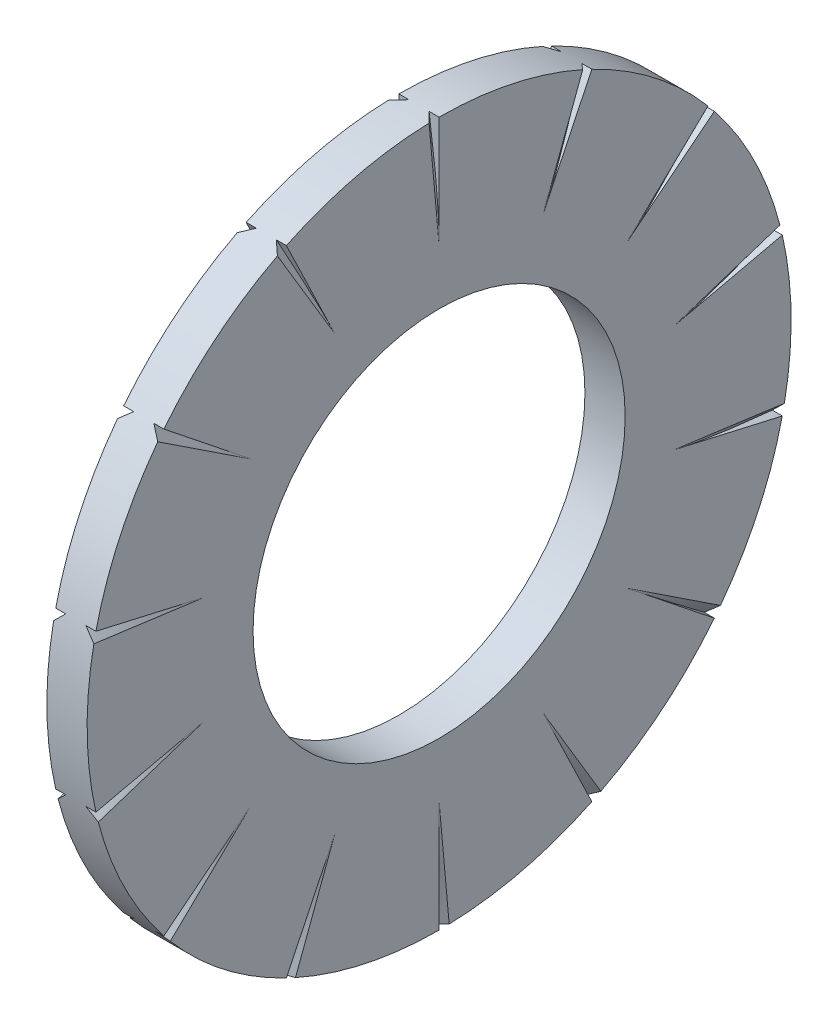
ISO-10303-21;
HEADER;
FILE_DESCRIPTION(('STEP AP214'),'2;1');
FILE_NAME('part.step','',(''),(''),'','','');
FILE_SCHEMA(('AUTOMOTIVE_DESIGN { 1 0 10303 214 1 1 1 1 }'));
ENDSEC;
DATA;
#1=APPLICATION_CONTEXT('core data for automotive mechanical design processes');
#2=APPLICATION_PROTOCOL_DEFINITION('international standard','automotive_design',2000,#1);
#3=PRODUCT_CONTEXT('',#1,'mechanical');
#4=PRODUCT('Part','Part','',(#3));
#5=PRODUCT_RELATED_PRODUCT_CATEGORY('part','',(#4));
#6=PRODUCT_DEFINITION_FORMATION('','',#4);
#7=PRODUCT_DEFINITION_CONTEXT('part definition',#1,'design');
#8=PRODUCT_DEFINITION('design','',#6,#7);
#9=PRODUCT_DEFINITION_SHAPE('','',#8);
#10=(LENGTH_UNIT() NAMED_UNIT(*) SI_UNIT(.MILLI.,.METRE.));
#11=(NAMED_UNIT(*) PLANE_ANGLE_UNIT() SI_UNIT($,.RADIAN.));
#12=(NAMED_UNIT(*) SI_UNIT($,.STERADIAN.) SOLID_ANGLE_UNIT());
#13=UNCERTAINTY_MEASURE_WITH_UNIT(LENGTH_MEASURE(1.E-05),#10,'distance_accuracy_value','');
#14=(GEOMETRIC_REPRESENTATION_CONTEXT(3) GLOBAL_UNCERTAINTY_ASSIGNED_CONTEXT((#13)) GLOBAL_UNIT_ASSIGNED_CONTEXT((#10,
#11,#12)) REPRESENTATION_CONTEXT('',''));
#15=CARTESIAN_POINT('',(0.,0.,0.));
#16=DIRECTION('',(0.,0.,1.));
#17=DIRECTION('',(1.,0.,0.));
#18=AXIS2_PLACEMENT_3D('',#15,#16,#17);
#19=CARTESIAN_POINT('',(0.8,0.,0.));
#20=DIRECTION('',(1.,0.,0.));
#21=DIRECTION('',(0.,0.,-1.));
#22=AXIS2_PLACEMENT_3D('',#19,#20,#21);
#23=PLANE('',#22);
#24=DIRECTION('',(0.,-0.858217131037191,-0.513286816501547));
#25=VECTOR('',#24,1.);
#26=CARTESIAN_POINT('',(0.8,5.26737261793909,2.64762458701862));
#27=LINE('',#26,#25);
#28=CARTESIAN_POINT('',(0.8,6.21754911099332,3.21591092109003));
#29=VERTEX_POINT('',#28);
#30=CARTESIAN_POINT('',(0.8,4.31473990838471,2.07786922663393));
#31=VERTEX_POINT('',#30);
#32=EDGE_CURVE('E1115',#29,#31,#27,.T.);
#33=ORIENTED_EDGE('',*,*,#32,.F.);
#34=CARTESIAN_POINT('',(0.8,0.,0.));
#35=DIRECTION('',(1.,0.,0.));
#36=DIRECTION('',(0.,0.,-1.));
#37=AXIS2_PLACEMENT_3D('',#34,#35,#36);
#38=CIRCLE('',#37,7.);
#39=CARTESIAN_POINT('',(0.8,4.3644286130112,5.47282037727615));
#40=VERTEX_POINT('',#39);
#41=EDGE_CURVE('E1363',#29,#40,#38,.T.);
#42=ORIENTED_EDGE('',*,*,#41,.T.);
#43=DIRECTION('',(0.,0.623489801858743,0.781831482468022));
#44=VECTOR('',#43,1.);
#45=CARTESIAN_POINT('',(0.8,3.67516063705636,4.60850567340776));
#46=LINE('',#45,#44);
#47=CARTESIAN_POINT('',(0.8,2.98589266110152,3.74419096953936));
#48=VERTEX_POINT('',#47);
#49=EDGE_CURVE('E1129',#48,#40,#46,.T.);
#50=ORIENTED_EDGE('',*,*,#49,.F.);
#51=DIRECTION('',(0.,-0.5505201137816,-0.834821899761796));
#52=VECTOR('',#51,1.);
#53=CARTESIAN_POINT('',(0.8,3.59697748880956,4.67085465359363));
#54=LINE('',#53,#52);
#55=CARTESIAN_POINT('',(0.8,4.20648672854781,5.59512907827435));
#56=VERTEX_POINT('',#55);
#57=EDGE_CURVE('E1130',#56,#48,#54,.T.);
#58=ORIENTED_EDGE('',*,*,#57,.F.);
#59=CARTESIAN_POINT('',(0.8,1.55764653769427,6.82449538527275));
#60=VERTEX_POINT('',#59);
#61=EDGE_CURVE('E1415',#56,#60,#38,.T.);
#62=ORIENTED_EDGE('',*,*,#61,.T.);
#63=DIRECTION('',(0.,0.222520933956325,0.974927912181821));
#64=VECTOR('',#63,1.);
#65=CARTESIAN_POINT('',(0.8,1.31164964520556,5.74671257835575));
#66=LINE('',#65,#64);
#67=CARTESIAN_POINT('',(0.8,1.06565275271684,4.66892977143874));
#68=VERTEX_POINT('',#67);
#69=EDGE_CURVE('E1145',#68,#60,#66,.T.);
#70=ORIENTED_EDGE('',*,*,#69,.F.);
#71=DIRECTION('',(0.,-0.133785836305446,-0.991010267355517));
#72=VECTOR('',#71,1.);
#73=CARTESIAN_POINT('',(0.8,1.21415685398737,5.76896467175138));
#74=LINE('',#73,#72);
#75=CARTESIAN_POINT('',(0.8,1.3622780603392,6.86616330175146));
#76=VERTEX_POINT('',#75);
#77=EDGE_CURVE('E1146',#76,#68,#74,.T.);
#78=ORIENTED_EDGE('',*,*,#77,.F.);
#79=CARTESIAN_POINT('',(0.8,-1.55764653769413,6.82449538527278));
#80=VERTEX_POINT('',#79);
#81=EDGE_CURVE('E1416',#76,#80,#38,.T.);
#82=ORIENTED_EDGE('',*,*,#81,.T.);
#83=DIRECTION('',(0.,-0.222520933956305,0.974927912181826));
#84=VECTOR('',#83,1.);
#85=CARTESIAN_POINT('',(0.8,-1.31164964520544,5.74671257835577));
#86=LINE('',#85,#84);
#87=CARTESIAN_POINT('',(0.8,-1.06565275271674,4.66892977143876));
#88=VERTEX_POINT('',#87);
#89=EDGE_CURVE('E1161',#88,#80,#86,.T.);
#90=ORIENTED_EDGE('',*,*,#89,.F.);
#91=DIRECTION('',(0.,0.309446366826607,-0.950916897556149));
#92=VECTOR('',#91,1.);
#93=CARTESIAN_POINT('',(0.8,-1.40914243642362,5.72446048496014));
#94=LINE('',#93,#92);
#95=CARTESIAN_POINT('',(0.8,-1.75174648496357,6.77726967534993));
#96=VERTEX_POINT('',#95);
#97=EDGE_CURVE('E1162',#96,#88,#94,.T.);
#98=ORIENTED_EDGE('',*,*,#97,.F.);
#99=CARTESIAN_POINT('',(0.8,-4.36442861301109,5.47282037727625));
#100=VERTEX_POINT('',#99);
#101=EDGE_CURVE('E1420',#96,#100,#38,.T.);
#102=ORIENTED_EDGE('',*,*,#101,.T.);
#103=DIRECTION('',(0.,-0.623489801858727,0.781831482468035));
#104=VECTOR('',#103,1.);
#105=CARTESIAN_POINT('',(0.8,-3.67516063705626,4.60850567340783));
#106=LINE('',#105,#104);
#107=CARTESIAN_POINT('',(0.8,-2.98589266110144,3.74419096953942));
#108=VERTEX_POINT('',#107);
#109=EDGE_CURVE('E1177',#108,#100,#106,.T.);
#110=ORIENTED_EDGE('',*,*,#109,.F.);
#111=DIRECTION('',(0.,0.691388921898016,-0.722482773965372));
#112=VECTOR('',#111,1.);
#113=CARTESIAN_POINT('',(0.8,-3.75334378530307,4.54615669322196));
#114=LINE('',#113,#112);
#115=CARTESIAN_POINT('',(0.8,-4.51881615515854,5.34605467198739));
#116=VERTEX_POINT('',#115);
#117=EDGE_CURVE('E1178',#116,#108,#114,.T.);
#118=ORIENTED_EDGE('',*,*,#117,.F.);
#119=CARTESIAN_POINT('',(0.8,-6.30678207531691,3.03718617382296));
#120=VERTEX_POINT('',#119);
#121=EDGE_CURVE('E1424',#116,#120,#38,.T.);
#122=ORIENTED_EDGE('',*,*,#121,.T.);
#123=DIRECTION('',(0.,-0.900968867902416,0.433883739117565));
#124=VECTOR('',#123,1.);
#125=CARTESIAN_POINT('',(0.8,-5.31076099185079,2.55752770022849));
#126=LINE('',#125,#124);
#127=CARTESIAN_POINT('',(0.8,-4.31473990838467,2.07786922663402));
#128=VERTEX_POINT('',#127);
#129=EDGE_CURVE('E1193',#128,#120,#126,.T.);
#130=ORIENTED_EDGE('',*,*,#129,.F.);
#131=DIRECTION('',(0.,0.936393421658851,-0.350952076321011));
#132=VECTOR('',#131,1.);
#133=CARTESIAN_POINT('',(0.8,-5.35414936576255,2.46743081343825));
#134=LINE('',#133,#132);
#135=CARTESIAN_POINT('',(0.8,-6.39087886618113,2.85598797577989));
#136=VERTEX_POINT('',#135);
#137=EDGE_CURVE('E1194',#136,#128,#134,.T.);
#138=ORIENTED_EDGE('',*,*,#137,.F.);
#139=CARTESIAN_POINT('',(0.8,-7.,0.));
#140=VERTEX_POINT('',#139);
#141=EDGE_CURVE('E1428',#136,#140,#38,.T.);
#142=ORIENTED_EDGE('',*,*,#141,.T.);
#143=DIRECTION('',(0.,-1.,0.));
#144=VECTOR('',#143,1.);
#145=CARTESIAN_POINT('',(0.8,-5.8945,0.));
#146=LINE('',#145,#144);
#147=CARTESIAN_POINT('',(0.8,-4.789,0.));
#148=VERTEX_POINT('',#147);
#149=EDGE_CURVE('E1209',#148,#140,#146,.T.);
#150=ORIENTED_EDGE('',*,*,#149,.F.);
#151=DIRECTION('',(0.,0.995933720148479,0.0900889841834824));
#152=VECTOR('',#151,1.);
#153=CARTESIAN_POINT('',(0.8,-5.8945,-0.0999999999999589));
#154=LINE('',#153,#152);
#155=CARTESIAN_POINT('',(0.8,-6.99714963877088,-0.199742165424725));
#156=VERTEX_POINT('',#155);
#157=EDGE_CURVE('E1210',#156,#148,#154,.T.);
#158=ORIENTED_EDGE('',*,*,#157,.F.);
#159=CARTESIAN_POINT('',(0.8,-6.30678207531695,-3.03718617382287));
#160=VERTEX_POINT('',#159);
#161=EDGE_CURVE('E1432',#156,#160,#38,.T.);
#162=ORIENTED_EDGE('',*,*,#161,.T.);
#163=DIRECTION('',(0.,-0.900968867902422,-0.433883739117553));
#164=VECTOR('',#163,1.);
#165=CARTESIAN_POINT('',(0.8,-5.31076099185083,-2.55752770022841));
#166=LINE('',#165,#164);
#167=CARTESIAN_POINT('',(0.8,-4.3147399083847,-2.07786922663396));
#168=VERTEX_POINT('',#167);
#169=EDGE_CURVE('E1225',#168,#160,#166,.T.);
#170=ORIENTED_EDGE('',*,*,#169,.F.);
#171=DIRECTION('',(0.,0.858217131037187,0.513286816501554));
#172=VECTOR('',#171,1.);
#173=CARTESIAN_POINT('',(0.8,-5.26737261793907,-2.64762458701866));
#174=LINE('',#173,#172);
#175=CARTESIAN_POINT('',(0.8,-6.2175491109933,-3.21591092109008));
#176=VERTEX_POINT('',#175);
#177=EDGE_CURVE('E1226',#176,#168,#174,.T.);
#178=ORIENTED_EDGE('',*,*,#177,.F.);
#179=CARTESIAN_POINT('',(0.8,-4.36442861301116,-5.47282037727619));
#180=VERTEX_POINT('',#179);
#181=EDGE_CURVE('E1436',#176,#180,#38,.T.);
#182=ORIENTED_EDGE('',*,*,#181,.T.);
#183=DIRECTION('',(0.,-0.623489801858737,-0.781831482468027));
#184=VECTOR('',#183,1.);
#185=CARTESIAN_POINT('',(0.8,-3.67516063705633,-4.60850567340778));
#186=LINE('',#185,#184);
#187=CARTESIAN_POINT('',(0.8,-2.98589266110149,-3.74419096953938));
#188=VERTEX_POINT('',#187);
#189=EDGE_CURVE('E1241',#188,#180,#186,.T.);
#190=ORIENTED_EDGE('',*,*,#189,.F.);
#191=DIRECTION('',(0.,0.550520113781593,0.8348218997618));
#192=VECTOR('',#191,1.);
#193=CARTESIAN_POINT('',(0.8,-3.59697748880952,-4.67085465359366));
#194=LINE('',#193,#192);
#195=CARTESIAN_POINT('',(0.8,-4.20648672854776,-5.59512907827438));
#196=VERTEX_POINT('',#195);
#197=EDGE_CURVE('E1242',#196,#188,#194,.T.);
#198=ORIENTED_EDGE('',*,*,#197,.F.);
#199=CARTESIAN_POINT('',(0.8,-1.55764653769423,-6.82449538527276));
#200=VERTEX_POINT('',#199);
#201=EDGE_CURVE('E1440',#196,#200,#38,.T.);
#202=ORIENTED_EDGE('',*,*,#201,.T.);
#203=DIRECTION('',(0.,-0.222520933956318,-0.974927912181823));
#204=VECTOR('',#203,1.);
#205=CARTESIAN_POINT('',(0.8,-1.31164964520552,-5.74671257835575));
#206=LINE('',#205,#204);
#207=CARTESIAN_POINT('',(0.8,-1.06565275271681,-4.66892977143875));
#208=VERTEX_POINT('',#207);
#209=EDGE_CURVE('E1257',#208,#200,#206,.T.);
#210=ORIENTED_EDGE('',*,*,#209,.F.);
#211=DIRECTION('',(0.,0.133785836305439,0.991010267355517));
#212=VECTOR('',#211,1.);
#213=CARTESIAN_POINT('',(0.8,-1.21415685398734,-5.76896467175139));
#214=LINE('',#213,#212);
#215=CARTESIAN_POINT('',(0.8,-1.36227806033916,-6.86616330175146));
#216=VERTEX_POINT('',#215);
#217=EDGE_CURVE('E1258',#216,#208,#214,.T.);
#218=ORIENTED_EDGE('',*,*,#217,.F.);
#219=CARTESIAN_POINT('',(0.8,1.55764653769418,-6.82449538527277));
#220=VERTEX_POINT('',#219);
#221=EDGE_CURVE('E1444',#216,#220,#38,.T.);
#222=ORIENTED_EDGE('',*,*,#221,.T.);
#223=DIRECTION('',(0.,0.222520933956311,-0.974927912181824));
#224=VECTOR('',#223,1.);
#225=CARTESIAN_POINT('',(0.8,1.31164964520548,-5.74671257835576));
#226=LINE('',#225,#224);
#227=CARTESIAN_POINT('',(0.8,1.06565275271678,-4.66892977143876));
#228=VERTEX_POINT('',#227);
#229=EDGE_CURVE('E1273',#228,#220,#226,.T.);
#230=ORIENTED_EDGE('',*,*,#229,.F.);
#231=DIRECTION('',(0.,-0.309446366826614,0.950916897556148));
#232=VECTOR('',#231,1.);
#233=CARTESIAN_POINT('',(0.8,1.40914243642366,-5.72446048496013));
#234=LINE('',#233,#232);
#235=CARTESIAN_POINT('',(0.8,1.75174648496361,-6.77726967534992));
#236=VERTEX_POINT('',#235);
#237=EDGE_CURVE('E1274',#236,#228,#234,.T.);
#238=ORIENTED_EDGE('',*,*,#237,.F.);
#239=CARTESIAN_POINT('',(0.8,4.36442861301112,-5.47282037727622));
#240=VERTEX_POINT('',#239);
#241=EDGE_CURVE('E1448',#236,#240,#38,.T.);
#242=ORIENTED_EDGE('',*,*,#241,.T.);
#243=DIRECTION('',(0.,0.623489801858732,-0.781831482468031));
#244=VECTOR('',#243,1.);
#245=CARTESIAN_POINT('',(0.8,3.6751606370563,-4.60850567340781));
#246=LINE('',#245,#244);
#247=CARTESIAN_POINT('',(0.8,2.98589266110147,-3.7441909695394));
#248=VERTEX_POINT('',#247);
#249=EDGE_CURVE('E1289',#248,#240,#246,.T.);
#250=ORIENTED_EDGE('',*,*,#249,.F.);
#251=DIRECTION('',(0.,-0.691388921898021,0.722482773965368));
#252=VECTOR('',#251,1.);
#253=CARTESIAN_POINT('',(0.8,3.7533437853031,-4.54615669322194));
#254=LINE('',#253,#252);
#255=CARTESIAN_POINT('',(0.8,4.51881615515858,-5.34605467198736));
#256=VERTEX_POINT('',#255);
#257=EDGE_CURVE('E1290',#256,#248,#254,.T.);
#258=ORIENTED_EDGE('',*,*,#257,.F.);
#259=CARTESIAN_POINT('',(0.8,6.30678207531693,-3.03718617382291));
#260=VERTEX_POINT('',#259);
#261=EDGE_CURVE('E1452',#256,#260,#38,.T.);
#262=ORIENTED_EDGE('',*,*,#261,.T.);
#263=DIRECTION('',(0.,0.900968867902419,-0.433883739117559));
#264=VECTOR('',#263,1.);
#265=CARTESIAN_POINT('',(0.8,5.31076099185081,-2.55752770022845));
#266=LINE('',#265,#264);
#267=CARTESIAN_POINT('',(0.8,4.31473990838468,-2.07786922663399));
#268=VERTEX_POINT('',#267);
#269=EDGE_CURVE('E1305',#268,#260,#266,.T.);
#270=ORIENTED_EDGE('',*,*,#269,.F.);
#271=DIRECTION('',(0.,-0.936393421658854,0.350952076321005));
#272=VECTOR('',#271,1.);
#273=CARTESIAN_POINT('',(0.8,5.35414936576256,-2.46743081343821));
#274=LINE('',#273,#272);
#275=CARTESIAN_POINT('',(0.8,6.39087886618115,-2.85598797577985));
#276=VERTEX_POINT('',#275);
#277=EDGE_CURVE('E1306',#276,#268,#274,.T.);
#278=ORIENTED_EDGE('',*,*,#277,.F.);
#279=CARTESIAN_POINT('',(0.8,7.,0.));
#280=VERTEX_POINT('',#279);
#281=EDGE_CURVE('E1358',#276,#280,#38,.T.);
#282=ORIENTED_EDGE('',*,*,#281,.T.);
#283=DIRECTION('',(0.,1.,0.));
#284=VECTOR('',#283,1.);
#285=CARTESIAN_POINT('',(0.8,5.8945,0.));
#286=LINE('',#285,#284);
#287=CARTESIAN_POINT('',(0.8,4.789,0.));
#288=VERTEX_POINT('',#287);
#289=EDGE_CURVE('E1337',#288,#280,#286,.T.);
#290=ORIENTED_EDGE('',*,*,#289,.F.);
#291=DIRECTION('',(0.,-0.995933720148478,-0.0900889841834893));
#292=VECTOR('',#291,1.);
#293=CARTESIAN_POINT('',(0.8,5.8945,0.1));
#294=LINE('',#293,#292);
#295=CARTESIAN_POINT('',(0.8,6.99714963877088,0.199742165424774));
#296=VERTEX_POINT('',#295);
#297=EDGE_CURVE('E1338',#296,#288,#294,.T.);
#298=ORIENTED_EDGE('',*,*,#297,.F.);
#299=CARTESIAN_POINT('',(0.8,6.30678207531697,3.03718617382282));
#300=VERTEX_POINT('',#299);
#301=EDGE_CURVE('E1359',#296,#300,#38,.T.);
#302=ORIENTED_EDGE('',*,*,#301,.T.);
#303=DIRECTION('',(0.,0.900968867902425,0.433883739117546));
#304=VECTOR('',#303,1.);
#305=CARTESIAN_POINT('',(0.8,5.31076099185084,2.55752770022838));
#306=LINE('',#305,#304);
#307=EDGE_CURVE('E1114',#31,#300,#306,.T.);
#308=ORIENTED_EDGE('',*,*,#307,.F.);
#309=EDGE_LOOP('',(#33,#42,#50,#58,#62,#70,#78,#82,#90,#98,#102,#110,#118,#122,#130,#138,#142,
#150,#158,#162,#170,#178,#182,#190,#198,#202,#210,#218,#222,#230,#238,#242,#250,#258,#262,#270,
#278,#282,#290,#298,#302,#308));
#310=FACE_BOUND('',#309,.T.);
#311=CARTESIAN_POINT('',(0.8,0.,0.));
#312=DIRECTION('',(1.,0.,0.));
#313=DIRECTION('',(0.,0.,-1.));
#314=AXIS2_PLACEMENT_3D('',#311,#312,#313);
#315=CIRCLE('',#314,3.7);
#316=CARTESIAN_POINT('',(0.8,0.,-3.7));
#317=VERTEX_POINT('',#316);
#318=EDGE_CURVE('E1351',#317,#317,#315,.T.);
#319=ORIENTED_EDGE('',*,*,#318,.F.);
#320=EDGE_LOOP('',(#319));
#321=FACE_BOUND('',#320,.T.);
#322=ADVANCED_FACE('F539',(#310,#321),#23,.T.);
#323=CARTESIAN_POINT('',(0.,0.,0.));
#324=DIRECTION('',(1.,0.,0.));
#325=DIRECTION('',(0.,0.,-1.));
#326=AXIS2_PLACEMENT_3D('',#323,#324,#325);
#327=PLANE('',#326);
#328=CARTESIAN_POINT('',(0.,0.,0.));
#329=DIRECTION('',(1.,0.,0.));
#330=DIRECTION('',(0.,0.,-1.));
#331=AXIS2_PLACEMENT_3D('',#328,#329,#330);
#332=CIRCLE('',#331,7.);
#333=CARTESIAN_POINT('',(0.,6.21754911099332,3.21591092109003));
#334=VERTEX_POINT('',#333);
#335=CARTESIAN_POINT('',(0.,4.3644286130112,5.47282037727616));
#336=VERTEX_POINT('',#335);
#337=EDGE_CURVE('E913',#334,#336,#332,.T.);
#338=ORIENTED_EDGE('',*,*,#337,.F.);
#339=DIRECTION('',(0.,-0.858217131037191,-0.513286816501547));
#340=VECTOR('',#339,1.);
#341=CARTESIAN_POINT('',(0.,5.26737261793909,2.64762458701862));
#342=LINE('',#341,#340);
#343=CARTESIAN_POINT('',(0.,4.31473990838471,2.07786922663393));
#344=VERTEX_POINT('',#343);
#345=EDGE_CURVE('E898',#334,#344,#342,.T.);
#346=ORIENTED_EDGE('',*,*,#345,.T.);
#347=DIRECTION('',(0.,0.900968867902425,0.433883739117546));
#348=VECTOR('',#347,1.);
#349=CARTESIAN_POINT('',(0.,5.31076099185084,2.55752770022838));
#350=LINE('',#349,#348);
#351=CARTESIAN_POINT('',(0.,6.30678207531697,3.03718617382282));
#352=VERTEX_POINT('',#351);
#353=EDGE_CURVE('E900',#344,#352,#350,.T.);
#354=ORIENTED_EDGE('',*,*,#353,.T.);
#355=CARTESIAN_POINT('',(0.,6.99714963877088,0.199742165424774));
#356=VERTEX_POINT('',#355);
#357=EDGE_CURVE('E1355',#356,#352,#332,.T.);
#358=ORIENTED_EDGE('',*,*,#357,.F.);
#359=DIRECTION('',(0.,-0.995933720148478,-0.0900889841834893));
#360=VECTOR('',#359,1.);
#361=CARTESIAN_POINT('',(0.,5.8945,0.1));
#362=LINE('',#361,#360);
#363=CARTESIAN_POINT('',(0.,4.789,0.));
#364=VERTEX_POINT('',#363);
#365=EDGE_CURVE('E1321',#356,#364,#362,.T.);
#366=ORIENTED_EDGE('',*,*,#365,.T.);
#367=DIRECTION('',(0.,1.,0.));
#368=VECTOR('',#367,1.);
#369=CARTESIAN_POINT('',(0.,5.8945,0.));
#370=LINE('',#369,#368);
#371=CARTESIAN_POINT('',(0.,7.,0.));
#372=VERTEX_POINT('',#371);
#373=EDGE_CURVE('E1320',#364,#372,#370,.T.);
#374=ORIENTED_EDGE('',*,*,#373,.T.);
#375=CARTESIAN_POINT('',(0.,6.39087886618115,-2.85598797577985));
#376=VERTEX_POINT('',#375);
#377=EDGE_CURVE('E1354',#376,#372,#332,.T.);
#378=ORIENTED_EDGE('',*,*,#377,.F.);
#379=DIRECTION('',(0.,-0.936393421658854,0.350952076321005));
#380=VECTOR('',#379,1.);
#381=CARTESIAN_POINT('',(0.,5.35414936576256,-2.46743081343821));
#382=LINE('',#381,#380);
#383=CARTESIAN_POINT('',(0.,4.31473990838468,-2.07786922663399));
#384=VERTEX_POINT('',#383);
#385=EDGE_CURVE('E1098',#376,#384,#382,.T.);
#386=ORIENTED_EDGE('',*,*,#385,.T.);
#387=DIRECTION('',(0.,0.900968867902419,-0.433883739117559));
#388=VECTOR('',#387,1.);
#389=CARTESIAN_POINT('',(0.,5.31076099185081,-2.55752770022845));
#390=LINE('',#389,#388);
#391=CARTESIAN_POINT('',(0.,6.30678207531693,-3.03718617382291));
#392=VERTEX_POINT('',#391);
#393=EDGE_CURVE('E1097',#384,#392,#390,.T.);
#394=ORIENTED_EDGE('',*,*,#393,.T.);
#395=CARTESIAN_POINT('',(0.,4.51881615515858,-5.34605467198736));
#396=VERTEX_POINT('',#395);
#397=EDGE_CURVE('E1768',#396,#392,#332,.T.);
#398=ORIENTED_EDGE('',*,*,#397,.F.);
#399=DIRECTION('',(0.,-0.691388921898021,0.722482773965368));
#400=VECTOR('',#399,1.);
#401=CARTESIAN_POINT('',(0.,3.7533437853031,-4.54615669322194));
#402=LINE('',#401,#400);
#403=CARTESIAN_POINT('',(0.,2.98589266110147,-3.7441909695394));
#404=VERTEX_POINT('',#403);
#405=EDGE_CURVE('E1082',#396,#404,#402,.T.);
#406=ORIENTED_EDGE('',*,*,#405,.T.);
#407=DIRECTION('',(0.,0.623489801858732,-0.781831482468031));
#408=VECTOR('',#407,1.);
#409=CARTESIAN_POINT('',(0.,3.6751606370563,-4.60850567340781));
#410=LINE('',#409,#408);
#411=CARTESIAN_POINT('',(0.,4.36442861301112,-5.47282037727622));
#412=VERTEX_POINT('',#411);
#413=EDGE_CURVE('E1081',#404,#412,#410,.T.);
#414=ORIENTED_EDGE('',*,*,#413,.T.);
#415=CARTESIAN_POINT('',(0.,1.75174648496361,-6.77726967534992));
#416=VERTEX_POINT('',#415);
#417=EDGE_CURVE('E1769',#416,#412,#332,.T.);
#418=ORIENTED_EDGE('',*,*,#417,.F.);
#419=DIRECTION('',(0.,-0.309446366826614,0.950916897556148));
#420=VECTOR('',#419,1.);
#421=CARTESIAN_POINT('',(0.,1.40914243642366,-5.72446048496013));
#422=LINE('',#421,#420);
#423=CARTESIAN_POINT('',(0.,1.06565275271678,-4.66892977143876));
#424=VERTEX_POINT('',#423);
#425=EDGE_CURVE('E1066',#416,#424,#422,.T.);
#426=ORIENTED_EDGE('',*,*,#425,.T.);
#427=DIRECTION('',(0.,0.222520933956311,-0.974927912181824));
#428=VECTOR('',#427,1.);
#429=CARTESIAN_POINT('',(0.,1.31164964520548,-5.74671257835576));
#430=LINE('',#429,#428);
#431=CARTESIAN_POINT('',(0.,1.55764653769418,-6.82449538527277));
#432=VERTEX_POINT('',#431);
#433=EDGE_CURVE('E1065',#424,#432,#430,.T.);
#434=ORIENTED_EDGE('',*,*,#433,.T.);
#435=CARTESIAN_POINT('',(0.,-1.36227806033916,-6.86616330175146));
#436=VERTEX_POINT('',#435);
#437=EDGE_CURVE('E1773',#436,#432,#332,.T.);
#438=ORIENTED_EDGE('',*,*,#437,.F.);
#439=DIRECTION('',(0.,0.133785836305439,0.991010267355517));
#440=VECTOR('',#439,1.);
#441=CARTESIAN_POINT('',(0.,-1.21415685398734,-5.76896467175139));
#442=LINE('',#441,#440);
#443=CARTESIAN_POINT('',(0.,-1.06565275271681,-4.66892977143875));
#444=VERTEX_POINT('',#443);
#445=EDGE_CURVE('E1050',#436,#444,#442,.T.);
#446=ORIENTED_EDGE('',*,*,#445,.T.);
#447=DIRECTION('',(0.,-0.222520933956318,-0.974927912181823));
#448=VECTOR('',#447,1.);
#449=CARTESIAN_POINT('',(0.,-1.31164964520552,-5.74671257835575));
#450=LINE('',#449,#448);
#451=CARTESIAN_POINT('',(0.,-1.55764653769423,-6.82449538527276));
#452=VERTEX_POINT('',#451);
#453=EDGE_CURVE('E1049',#444,#452,#450,.T.);
#454=ORIENTED_EDGE('',*,*,#453,.T.);
#455=CARTESIAN_POINT('',(0.,-4.20648672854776,-5.59512907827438));
#456=VERTEX_POINT('',#455);
#457=EDGE_CURVE('E1777',#456,#452,#332,.T.);
#458=ORIENTED_EDGE('',*,*,#457,.F.);
#459=DIRECTION('',(0.,0.550520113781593,0.8348218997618));
#460=VECTOR('',#459,1.);
#461=CARTESIAN_POINT('',(0.,-3.59697748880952,-4.67085465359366));
#462=LINE('',#461,#460);
#463=CARTESIAN_POINT('',(0.,-2.98589266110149,-3.74419096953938));
#464=VERTEX_POINT('',#463);
#465=EDGE_CURVE('E1034',#456,#464,#462,.T.);
#466=ORIENTED_EDGE('',*,*,#465,.T.);
#467=DIRECTION('',(0.,-0.623489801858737,-0.781831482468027));
#468=VECTOR('',#467,1.);
#469=CARTESIAN_POINT('',(0.,-3.67516063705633,-4.60850567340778));
#470=LINE('',#469,#468);
#471=CARTESIAN_POINT('',(0.,-4.36442861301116,-5.47282037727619));
#472=VERTEX_POINT('',#471);
#473=EDGE_CURVE('E1033',#464,#472,#470,.T.);
#474=ORIENTED_EDGE('',*,*,#473,.T.);
#475=CARTESIAN_POINT('',(0.,-6.2175491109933,-3.21591092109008));
#476=VERTEX_POINT('',#475);
#477=EDGE_CURVE('E1781',#476,#472,#332,.T.);
#478=ORIENTED_EDGE('',*,*,#477,.F.);
#479=DIRECTION('',(0.,0.858217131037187,0.513286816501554));
#480=VECTOR('',#479,1.);
#481=CARTESIAN_POINT('',(0.,-5.26737261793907,-2.64762458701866));
#482=LINE('',#481,#480);
#483=CARTESIAN_POINT('',(0.,-4.3147399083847,-2.07786922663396));
#484=VERTEX_POINT('',#483);
#485=EDGE_CURVE('E1018',#476,#484,#482,.T.);
#486=ORIENTED_EDGE('',*,*,#485,.T.);
#487=DIRECTION('',(0.,-0.900968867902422,-0.433883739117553));
#488=VECTOR('',#487,1.);
#489=CARTESIAN_POINT('',(0.,-5.31076099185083,-2.55752770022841));
#490=LINE('',#489,#488);
#491=CARTESIAN_POINT('',(0.,-6.30678207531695,-3.03718617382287));
#492=VERTEX_POINT('',#491);
#493=EDGE_CURVE('E1017',#484,#492,#490,.T.);
#494=ORIENTED_EDGE('',*,*,#493,.T.);
#495=CARTESIAN_POINT('',(0.,-6.99714963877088,-0.199742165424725));
#496=VERTEX_POINT('',#495);
#497=EDGE_CURVE('E1785',#496,#492,#332,.T.);
#498=ORIENTED_EDGE('',*,*,#497,.F.);
#499=DIRECTION('',(0.,0.995933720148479,0.0900889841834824));
#500=VECTOR('',#499,1.);
#501=CARTESIAN_POINT('',(0.,-5.8945,-0.0999999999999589));
#502=LINE('',#501,#500);
#503=CARTESIAN_POINT('',(0.,-4.789,0.));
#504=VERTEX_POINT('',#503);
#505=EDGE_CURVE('E1002',#496,#504,#502,.T.);
#506=ORIENTED_EDGE('',*,*,#505,.T.);
#507=DIRECTION('',(0.,-1.,0.));
#508=VECTOR('',#507,1.);
#509=CARTESIAN_POINT('',(0.,-5.8945,0.));
#510=LINE('',#509,#508);
#511=CARTESIAN_POINT('',(0.,-7.,0.));
#512=VERTEX_POINT('',#511);
#513=EDGE_CURVE('E1001',#504,#512,#510,.T.);
#514=ORIENTED_EDGE('',*,*,#513,.T.);
#515=CARTESIAN_POINT('',(0.,-6.39087886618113,2.85598797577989));
#516=VERTEX_POINT('',#515);
#517=EDGE_CURVE('E1789',#516,#512,#332,.T.);
#518=ORIENTED_EDGE('',*,*,#517,.F.);
#519=DIRECTION('',(0.,0.936393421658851,-0.350952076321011));
#520=VECTOR('',#519,1.);
#521=CARTESIAN_POINT('',(0.,-5.35414936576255,2.46743081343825));
#522=LINE('',#521,#520);
#523=CARTESIAN_POINT('',(0.,-4.31473990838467,2.07786922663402));
#524=VERTEX_POINT('',#523);
#525=EDGE_CURVE('E986',#516,#524,#522,.T.);
#526=ORIENTED_EDGE('',*,*,#525,.T.);
#527=DIRECTION('',(0.,-0.900968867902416,0.433883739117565));
#528=VECTOR('',#527,1.);
#529=CARTESIAN_POINT('',(0.,-5.31076099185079,2.55752770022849));
#530=LINE('',#529,#528);
#531=CARTESIAN_POINT('',(0.,-6.30678207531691,3.03718617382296));
#532=VERTEX_POINT('',#531);
#533=EDGE_CURVE('E985',#524,#532,#530,.T.);
#534=ORIENTED_EDGE('',*,*,#533,.T.);
#535=CARTESIAN_POINT('',(0.,-4.51881615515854,5.34605467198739));
#536=VERTEX_POINT('',#535);
#537=EDGE_CURVE('E1793',#536,#532,#332,.T.);
#538=ORIENTED_EDGE('',*,*,#537,.F.);
#539=DIRECTION('',(0.,0.691388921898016,-0.722482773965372));
#540=VECTOR('',#539,1.);
#541=CARTESIAN_POINT('',(0.,-3.75334378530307,4.54615669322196));
#542=LINE('',#541,#540);
#543=CARTESIAN_POINT('',(0.,-2.98589266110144,3.74419096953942));
#544=VERTEX_POINT('',#543);
#545=EDGE_CURVE('E970',#536,#544,#542,.T.);
#546=ORIENTED_EDGE('',*,*,#545,.T.);
#547=DIRECTION('',(0.,-0.623489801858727,0.781831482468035));
#548=VECTOR('',#547,1.);
#549=CARTESIAN_POINT('',(0.,-3.67516063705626,4.60850567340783));
#550=LINE('',#549,#548);
#551=CARTESIAN_POINT('',(0.,-4.36442861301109,5.47282037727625));
#552=VERTEX_POINT('',#551);
#553=EDGE_CURVE('E969',#544,#552,#550,.T.);
#554=ORIENTED_EDGE('',*,*,#553,.T.);
#555=CARTESIAN_POINT('',(0.,-1.75174648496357,6.77726967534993));
#556=VERTEX_POINT('',#555);
#557=EDGE_CURVE('E1797',#556,#552,#332,.T.);
#558=ORIENTED_EDGE('',*,*,#557,.F.);
#559=DIRECTION('',(0.,0.309446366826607,-0.950916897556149));
#560=VECTOR('',#559,1.);
#561=CARTESIAN_POINT('',(0.,-1.40914243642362,5.72446048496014));
#562=LINE('',#561,#560);
#563=CARTESIAN_POINT('',(0.,-1.06565275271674,4.66892977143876));
#564=VERTEX_POINT('',#563);
#565=EDGE_CURVE('E954',#556,#564,#562,.T.);
#566=ORIENTED_EDGE('',*,*,#565,.T.);
#567=DIRECTION('',(0.,-0.222520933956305,0.974927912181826));
#568=VECTOR('',#567,1.);
#569=CARTESIAN_POINT('',(0.,-1.31164964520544,5.74671257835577));
#570=LINE('',#569,#568);
#571=CARTESIAN_POINT('',(0.,-1.55764653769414,6.82449538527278));
#572=VERTEX_POINT('',#571);
#573=EDGE_CURVE('E953',#564,#572,#570,.T.);
#574=ORIENTED_EDGE('',*,*,#573,.T.);
#575=CARTESIAN_POINT('',(0.,1.3622780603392,6.86616330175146));
#576=VERTEX_POINT('',#575);
#577=EDGE_CURVE('E1801',#576,#572,#332,.T.);
#578=ORIENTED_EDGE('',*,*,#577,.F.);
#579=DIRECTION('',(0.,-0.133785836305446,-0.991010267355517));
#580=VECTOR('',#579,1.);
#581=CARTESIAN_POINT('',(0.,1.21415685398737,5.76896467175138));
#582=LINE('',#581,#580);
#583=CARTESIAN_POINT('',(0.,1.06565275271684,4.66892977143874));
#584=VERTEX_POINT('',#583);
#585=EDGE_CURVE('E938',#576,#584,#582,.T.);
#586=ORIENTED_EDGE('',*,*,#585,.T.);
#587=DIRECTION('',(0.,0.222520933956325,0.974927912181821));
#588=VECTOR('',#587,1.);
#589=CARTESIAN_POINT('',(0.,1.31164964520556,5.74671257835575));
#590=LINE('',#589,#588);
#591=CARTESIAN_POINT('',(0.,1.55764653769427,6.82449538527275));
#592=VERTEX_POINT('',#591);
#593=EDGE_CURVE('E937',#584,#592,#590,.T.);
#594=ORIENTED_EDGE('',*,*,#593,.T.);
#595=CARTESIAN_POINT('',(0.,4.20648672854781,5.59512907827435));
#596=VERTEX_POINT('',#595);
#597=EDGE_CURVE('E1805',#596,#592,#332,.T.);
#598=ORIENTED_EDGE('',*,*,#597,.F.);
#599=DIRECTION('',(0.,-0.5505201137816,-0.834821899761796));
#600=VECTOR('',#599,1.);
#601=CARTESIAN_POINT('',(0.,3.59697748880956,4.67085465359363));
#602=LINE('',#601,#600);
#603=CARTESIAN_POINT('',(0.,2.98589266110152,3.74419096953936));
#604=VERTEX_POINT('',#603);
#605=EDGE_CURVE('E923',#596,#604,#602,.T.);
#606=ORIENTED_EDGE('',*,*,#605,.T.);
#607=DIRECTION('',(0.,0.623489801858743,0.781831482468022));
#608=VECTOR('',#607,1.);
#609=CARTESIAN_POINT('',(0.,3.67516063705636,4.60850567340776));
#610=LINE('',#609,#608);
#611=EDGE_CURVE('E922',#604,#336,#610,.T.);
#612=ORIENTED_EDGE('',*,*,#611,.T.);
#613=EDGE_LOOP('',(#338,#346,#354,#358,#366,#374,#378,#386,#394,#398,#406,#414,#418,#426,#434,
#438,#446,#454,#458,#466,#474,#478,#486,#494,#498,#506,#514,#518,#526,#534,#538,#546,#554,#558,
#566,#574,#578,#586,#594,#598,#606,#612));
#614=FACE_BOUND('',#613,.T.);
#615=CARTESIAN_POINT('',(0.,0.,0.));
#616=DIRECTION('',(1.,0.,0.));
#617=DIRECTION('',(0.,0.,-1.));
#618=AXIS2_PLACEMENT_3D('',#615,#616,#617);
#619=CIRCLE('',#618,3.7);
#620=CARTESIAN_POINT('',(0.,0.,-3.7));
#621=VERTEX_POINT('',#620);
#622=EDGE_CURVE('E1348',#621,#621,#619,.T.);
#623=ORIENTED_EDGE('',*,*,#622,.T.);
#624=EDGE_LOOP('',(#623));
#625=FACE_BOUND('',#624,.T.);
#626=ADVANCED_FACE('F910',(#614,#625),#327,.F.);
#627=CARTESIAN_POINT('',(0.8,0.,0.));
#628=DIRECTION('',(-1.,0.,0.));
#629=DIRECTION('',(0.,0.,1.));
#630=AXIS2_PLACEMENT_3D('',#627,#628,#629);
#631=CYLINDRICAL_SURFACE('',#630,7.);
#632=ORIENTED_EDGE('',*,*,#41,.F.);
#633=CARTESIAN_POINT('',(0.8,6.21754911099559,3.21591092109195));
#634=CARTESIAN_POINT('',(0.783320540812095,6.225200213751,3.20111845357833));
#635=CARTESIAN_POINT('',(0.766640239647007,6.23279816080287,3.18629947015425));
#636=CARTESIAN_POINT('',(0.733280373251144,6.24788842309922,3.15660699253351));
#637=CARTESIAN_POINT('',(0.716600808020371,6.25538073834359,3.14173349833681));
#638=CARTESIAN_POINT('',(0.666605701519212,6.27768292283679,3.09706374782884));
#639=CARTESIAN_POINT('',(0.633294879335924,6.29233585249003,3.06718376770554));
#640=CARTESIAN_POINT('',(0.6,6.30678207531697,3.03718617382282));
#641=B_SPLINE_CURVE_WITH_KNOTS('',3,(#633,#634,#635,#636,#637,#638,#639,#640),.UNSPECIFIED.,.F.,
.F.,(4,2,2,4),(0.,0.0707109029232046,0.141421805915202,0.282678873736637),.UNSPECIFIED.);
#642=CARTESIAN_POINT('',(0.6,6.30678207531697,3.03718617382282));
#643=VERTEX_POINT('',#642);
#644=EDGE_CURVE('E1413',#29,#643,#641,.T.);
#645=ORIENTED_EDGE('',*,*,#644,.T.);
#646=DIRECTION('',(-1.,0.,0.));
#647=VECTOR('',#646,1.);
#648=CARTESIAN_POINT('',(0.6,6.30678207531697,3.03718617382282));
#649=LINE('',#648,#647);
#650=EDGE_CURVE('E1120',#300,#643,#649,.T.);
#651=ORIENTED_EDGE('',*,*,#650,.F.);
#652=ORIENTED_EDGE('',*,*,#301,.F.);
#653=CARTESIAN_POINT('',(0.8,6.99714963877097,0.199742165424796));
#654=CARTESIAN_POINT('',(0.783320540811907,6.99762483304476,0.183094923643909));
#655=CARTESIAN_POINT('',(0.766640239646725,6.99804063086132,0.16644685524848));
#656=CARTESIAN_POINT('',(0.733280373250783,6.99875340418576,0.133147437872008));
#657=CARTESIAN_POINT('',(0.716600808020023,6.99905037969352,0.116496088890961));
#658=CARTESIAN_POINT('',(0.666605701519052,6.99976247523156,0.0665734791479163));
#659=CARTESIAN_POINT('',(0.633294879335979,6.99999987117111,0.0332948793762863));
#660=CARTESIAN_POINT('',(0.6,7.,0.));
#661=B_SPLINE_CURVE_WITH_KNOTS('',3,(#653,#654,#655,#656,#657,#658,#659,#660),.UNSPECIFIED.,.F.,
.F.,(4,2,2,4),(0.,0.0707109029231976,0.141421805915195,0.282678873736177),.UNSPECIFIED.);
#662=CARTESIAN_POINT('',(0.6,7.,0.));
#663=VERTEX_POINT('',#662);
#664=EDGE_CURVE('E1362',#296,#663,#661,.T.);
#665=ORIENTED_EDGE('',*,*,#664,.T.);
#666=DIRECTION('',(-1.,0.,0.));
#667=VECTOR('',#666,1.);
#668=CARTESIAN_POINT('',(0.6,7.,0.));
#669=LINE('',#668,#667);
#670=EDGE_CURVE('E1343',#280,#663,#669,.T.);
#671=ORIENTED_EDGE('',*,*,#670,.F.);
#672=ORIENTED_EDGE('',*,*,#281,.F.);
#673=CARTESIAN_POINT('',(0.8,6.39087886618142,-2.8559879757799));
#674=CARTESIAN_POINT('',(0.78332054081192,6.38408403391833,-2.87119280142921));
#675=CARTESIAN_POINT('',(0.766640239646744,6.37723532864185,-2.88637260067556));
#676=CARTESIAN_POINT('',(0.733280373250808,6.36342943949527,-2.91668359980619));
#677=CARTESIAN_POINT('',(0.716600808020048,6.35647225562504,-2.93181479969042));
#678=CARTESIAN_POINT('',(0.666605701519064,6.33545322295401,-2.97710248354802));
#679=CARTESIAN_POINT('',(0.633294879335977,6.32122806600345,-3.00718846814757));
#680=CARTESIAN_POINT('',(0.6,6.30678207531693,-3.03718617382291));
#681=B_SPLINE_CURVE_WITH_KNOTS('',3,(#673,#674,#675,#676,#677,#678,#679,#680),.UNSPECIFIED.,.F.,
.F.,(4,2,2,4),(0.,0.0707109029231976,0.141421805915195,0.282678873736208),.UNSPECIFIED.);
#682=CARTESIAN_POINT('',(0.6,6.30678207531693,-3.03718617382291));
#683=VERTEX_POINT('',#682);
#684=EDGE_CURVE('E1729',#276,#683,#681,.T.);
#685=ORIENTED_EDGE('',*,*,#684,.T.);
#686=DIRECTION('',(-1.,0.,0.));
#687=VECTOR('',#686,1.);
#688=CARTESIAN_POINT('',(0.6,6.30678207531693,-3.03718617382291));
#689=LINE('',#688,#687);
#690=EDGE_CURVE('E1311',#260,#683,#689,.T.);
#691=ORIENTED_EDGE('',*,*,#690,.F.);
#692=ORIENTED_EDGE('',*,*,#261,.F.);
#693=CARTESIAN_POINT('',(0.8,4.51881615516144,-5.34605467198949));
#694=CARTESIAN_POINT('',(0.783320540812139,4.50609709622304,-5.35680557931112));
#695=CARTESIAN_POINT('',(0.766640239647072,4.49334035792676,-5.36751056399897));
#696=CARTESIAN_POINT('',(0.733280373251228,4.46775023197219,-5.38882967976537));
#697=CARTESIAN_POINT('',(0.716600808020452,4.45491684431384,-5.39944381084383));
#698=CARTESIAN_POINT('',(0.666605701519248,4.4163297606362,-5.43112678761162));
#699=CARTESIAN_POINT('',(0.63329487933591,4.39045951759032,-5.45206125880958));
#700=CARTESIAN_POINT('',(0.6,4.36442861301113,-5.47282037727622));
#701=B_SPLINE_CURVE_WITH_KNOTS('',3,(#693,#694,#695,#696,#697,#698,#699,#700),.UNSPECIFIED.,.F.,
.F.,(4,2,2,4),(0.,0.0707109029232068,0.141421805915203,0.282678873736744),.UNSPECIFIED.);
#702=CARTESIAN_POINT('',(0.6,4.36442861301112,-5.47282037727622));
#703=VERTEX_POINT('',#702);
#704=EDGE_CURVE('E1724',#256,#703,#701,.T.);
#705=ORIENTED_EDGE('',*,*,#704,.T.);
#706=DIRECTION('',(-1.,0.,0.));
#707=VECTOR('',#706,1.);
#708=CARTESIAN_POINT('',(0.6,4.36442861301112,-5.47282037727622));
#709=LINE('',#708,#707);
#710=EDGE_CURVE('E1295',#240,#703,#709,.T.);
#711=ORIENTED_EDGE('',*,*,#710,.F.);
#712=ORIENTED_EDGE('',*,*,#241,.F.);
#713=CARTESIAN_POINT('',(0.8,1.75174648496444,-6.77726967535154));
#714=CARTESIAN_POINT('',(0.783320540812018,1.73562236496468,-6.78143731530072));
#715=CARTESIAN_POINT('',(0.766640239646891,1.71948422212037,-6.78554723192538));
#716=CARTESIAN_POINT('',(0.733280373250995,1.68717829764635,-6.79365195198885));
#717=CARTESIAN_POINT('',(0.716600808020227,1.67101051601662,-6.79764675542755));
#718=CARTESIAN_POINT('',(0.666605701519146,1.62249802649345,-6.80944982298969));
#719=CARTESIAN_POINT('',(0.633294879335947,1.59010661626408,-6.81708645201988));
#720=CARTESIAN_POINT('',(0.6,1.55764653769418,-6.82449538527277));
#721=B_SPLINE_CURVE_WITH_KNOTS('',3,(#713,#714,#715,#716,#717,#718,#719,#720),.UNSPECIFIED.,.F.,
.F.,(4,2,2,4),(0.,0.0707109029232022,0.1414218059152,0.282678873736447),.UNSPECIFIED.);
#722=CARTESIAN_POINT('',(0.6,1.55764653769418,-6.82449538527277));
#723=VERTEX_POINT('',#722);
#724=EDGE_CURVE('E1673',#236,#723,#721,.T.);
#725=ORIENTED_EDGE('',*,*,#724,.T.);
#726=DIRECTION('',(-1.,0.,0.));
#727=VECTOR('',#726,1.);
#728=CARTESIAN_POINT('',(0.6,1.55764653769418,-6.82449538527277));
#729=LINE('',#728,#727);
#730=EDGE_CURVE('E1279',#220,#723,#729,.T.);
#731=ORIENTED_EDGE('',*,*,#730,.F.);
#732=ORIENTED_EDGE('',*,*,#221,.F.);
#733=CARTESIAN_POINT('',(0.8,-1.36227806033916,-6.86616330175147));
#734=CARTESIAN_POINT('',(0.783320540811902,-1.3786136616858,-6.86292222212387));
#735=CARTESIAN_POINT('',(0.766640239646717,-1.3949368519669,-6.85962305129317));
#736=CARTESIAN_POINT('',(0.733280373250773,-1.42755999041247,-6.85290813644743));
#737=CARTESIAN_POINT('',(0.716600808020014,-1.44385993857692,-6.84949239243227));
#738=CARTESIAN_POINT('',(0.666605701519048,-1.49268934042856,-6.83907780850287));
#739=CARTESIAN_POINT('',(0.633294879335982,-1.52518640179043,-6.8319040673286));
#740=CARTESIAN_POINT('',(0.6,-1.55764653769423,-6.82449538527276));
#741=B_SPLINE_CURVE_WITH_KNOTS('',3,(#733,#734,#735,#736,#737,#738,#739,#740),.UNSPECIFIED.,.F.,
.F.,(4,2,2,4),(0.,0.0707109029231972,0.141421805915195,0.282678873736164),.UNSPECIFIED.);
#742=CARTESIAN_POINT('',(0.6,-1.55764653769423,-6.82449538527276));
#743=VERTEX_POINT('',#742);
#744=EDGE_CURVE('E1667',#216,#743,#741,.T.);
#745=ORIENTED_EDGE('',*,*,#744,.T.);
#746=DIRECTION('',(-1.,0.,0.));
#747=VECTOR('',#746,1.);
#748=CARTESIAN_POINT('',(0.6,-1.55764653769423,-6.82449538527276));
#749=LINE('',#748,#747);
#750=EDGE_CURVE('E1263',#200,#743,#749,.T.);
#751=ORIENTED_EDGE('',*,*,#750,.F.);
#752=ORIENTED_EDGE('',*,*,#201,.F.);
#753=CARTESIAN_POINT('',(0.8,-4.20648672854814,-5.59512907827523));
#754=CARTESIAN_POINT('',(0.783320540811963,-4.21979834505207,-5.5851212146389));
#755=CARTESIAN_POINT('',(0.766640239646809,-4.23307357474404,-5.57506639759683));
#756=CARTESIAN_POINT('',(0.73328037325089,-4.25955251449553,-5.55486181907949));
#757=CARTESIAN_POINT('',(0.716600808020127,-4.27275622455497,-5.54471205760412));
#758=CARTESIAN_POINT('',(0.6666057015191,-4.31223127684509,-5.51414255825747));
#759=CARTESIAN_POINT('',(0.633294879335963,-4.33839754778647,-5.49357929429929));
#760=CARTESIAN_POINT('',(0.6,-4.36442861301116,-5.47282037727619));
#761=B_SPLINE_CURVE_WITH_KNOTS('',3,(#753,#754,#755,#756,#757,#758,#759,#760),.UNSPECIFIED.,.F.,
.F.,(4,2,2,4),(0.,0.0707109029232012,0.141421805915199,0.282678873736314),.UNSPECIFIED.);
#762=CARTESIAN_POINT('',(0.6,-4.36442861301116,-5.47282037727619));
#763=VERTEX_POINT('',#762);
#764=EDGE_CURVE('E1661',#196,#763,#761,.T.);
#765=ORIENTED_EDGE('',*,*,#764,.T.);
#766=DIRECTION('',(-1.,0.,0.));
#767=VECTOR('',#766,1.);
#768=CARTESIAN_POINT('',(0.6,-4.36442861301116,-5.47282037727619));
#769=LINE('',#768,#767);
#770=EDGE_CURVE('E1247',#180,#763,#769,.T.);
#771=ORIENTED_EDGE('',*,*,#770,.F.);
#772=ORIENTED_EDGE('',*,*,#181,.F.);
#773=CARTESIAN_POINT('',(0.8,-6.21754911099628,-3.21591092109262));
#774=CARTESIAN_POINT('',(0.783320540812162,-6.22520021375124,-3.20111845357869));
#775=CARTESIAN_POINT('',(0.766640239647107,-6.2327981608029,-3.18629947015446));
#776=CARTESIAN_POINT('',(0.733280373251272,-6.24788842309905,-3.15660699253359));
#777=CARTESIAN_POINT('',(0.716600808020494,-6.25538073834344,-3.14173349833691));
#778=CARTESIAN_POINT('',(0.666605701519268,-6.27768292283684,-3.09706374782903));
#779=CARTESIAN_POINT('',(0.633294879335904,-6.29233585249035,-3.06718376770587));
#780=CARTESIAN_POINT('',(0.6,-6.30678207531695,-3.03718617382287));
#781=B_SPLINE_CURVE_WITH_KNOTS('',3,(#773,#774,#775,#776,#777,#778,#779,#780),.UNSPECIFIED.,.F.,
.F.,(4,2,2,4),(0.,0.070710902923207,0.141421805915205,0.2826788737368),.UNSPECIFIED.);
#782=CARTESIAN_POINT('',(0.6,-6.30678207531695,-3.03718617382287));
#783=VERTEX_POINT('',#782);
#784=EDGE_CURVE('E1610',#176,#783,#781,.T.);
#785=ORIENTED_EDGE('',*,*,#784,.T.);
#786=DIRECTION('',(-1.,0.,0.));
#787=VECTOR('',#786,1.);
#788=CARTESIAN_POINT('',(0.6,-6.30678207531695,-3.03718617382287));
#789=LINE('',#788,#787);
#790=EDGE_CURVE('E1231',#160,#783,#789,.T.);
#791=ORIENTED_EDGE('',*,*,#790,.F.);
#792=ORIENTED_EDGE('',*,*,#161,.F.);
#793=CARTESIAN_POINT('',(0.8,-6.99714963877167,-0.19974216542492));
#794=CARTESIAN_POINT('',(0.783320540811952,-6.99762483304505,-0.183094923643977));
#795=CARTESIAN_POINT('',(0.766640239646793,-6.99804063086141,-0.16644685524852));
#796=CARTESIAN_POINT('',(0.733280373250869,-6.99875340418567,-0.133147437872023));
#797=CARTESIAN_POINT('',(0.716600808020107,-6.99905037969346,-0.11649608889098));
#798=CARTESIAN_POINT('',(0.666605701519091,-6.99976247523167,-0.0665734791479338));
#799=CARTESIAN_POINT('',(0.633294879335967,-6.99999987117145,-0.0332948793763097));
#800=CARTESIAN_POINT('',(0.6,-7.,0.));
#801=B_SPLINE_CURVE_WITH_KNOTS('',3,(#793,#794,#795,#796,#797,#798,#799,#800),.UNSPECIFIED.,.F.,
.F.,(4,2,2,4),(0.,0.0707109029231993,0.141421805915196,0.282678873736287),.UNSPECIFIED.);
#802=CARTESIAN_POINT('',(0.6,-7.,0.));
#803=VERTEX_POINT('',#802);
#804=EDGE_CURVE('E1604',#156,#803,#801,.T.);
#805=ORIENTED_EDGE('',*,*,#804,.T.);
#806=DIRECTION('',(-1.,0.,0.));
#807=VECTOR('',#806,1.);
#808=CARTESIAN_POINT('',(0.6,-7.,0.));
#809=LINE('',#808,#807);
#810=EDGE_CURVE('E1215',#140,#803,#809,.T.);
#811=ORIENTED_EDGE('',*,*,#810,.F.);
#812=ORIENTED_EDGE('',*,*,#141,.F.);
#813=CARTESIAN_POINT('',(0.8,-6.39087886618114,2.85598797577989));
#814=CARTESIAN_POINT('',(0.783320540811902,-6.38408403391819,2.87119280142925));
#815=CARTESIAN_POINT('',(0.766640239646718,-6.37723532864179,2.88637260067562));
#816=CARTESIAN_POINT('',(0.733280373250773,-6.36342943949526,2.91668359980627));
#817=CARTESIAN_POINT('',(0.716600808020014,-6.35647225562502,2.9318147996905));
#818=CARTESIAN_POINT('',(0.666605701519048,-6.33545322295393,2.97710248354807));
#819=CARTESIAN_POINT('',(0.633294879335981,-6.32122806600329,3.00718846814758));
#820=CARTESIAN_POINT('',(0.6,-6.30678207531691,3.03718617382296));
#821=B_SPLINE_CURVE_WITH_KNOTS('',3,(#813,#814,#815,#816,#817,#818,#819,#820),.UNSPECIFIED.,.F.,
.F.,(4,2,2,4),(0.,0.0707109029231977,0.141421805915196,0.282678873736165),.UNSPECIFIED.);
#822=CARTESIAN_POINT('',(0.6,-6.30678207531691,3.03718617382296));
#823=VERTEX_POINT('',#822);
#824=EDGE_CURVE('E1598',#136,#823,#821,.T.);
#825=ORIENTED_EDGE('',*,*,#824,.T.);
#826=DIRECTION('',(-1.,0.,0.));
#827=VECTOR('',#826,1.);
#828=CARTESIAN_POINT('',(0.6,-6.30678207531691,3.03718617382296));
#829=LINE('',#828,#827);
#830=EDGE_CURVE('E1199',#120,#823,#829,.T.);
#831=ORIENTED_EDGE('',*,*,#830,.F.);
#832=ORIENTED_EDGE('',*,*,#121,.F.);
#833=CARTESIAN_POINT('',(0.8,-4.51881615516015,5.34605467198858));
#834=CARTESIAN_POINT('',(0.783320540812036,-4.50609709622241,5.35680557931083));
#835=CARTESIAN_POINT('',(0.766640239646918,-4.49334035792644,5.36751056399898));
#836=CARTESIAN_POINT('',(0.733280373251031,-4.46775023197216,5.38882967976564));
#837=CARTESIAN_POINT('',(0.716600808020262,-4.45491684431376,5.39944381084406));
#838=CARTESIAN_POINT('',(0.666605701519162,-4.41632976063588,5.43112678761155));
#839=CARTESIAN_POINT('',(0.633294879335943,-4.39045951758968,5.45206125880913));
#840=CARTESIAN_POINT('',(0.6,-4.36442861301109,5.47282037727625));
#841=B_SPLINE_CURVE_WITH_KNOTS('',3,(#833,#834,#835,#836,#837,#838,#839,#840),.UNSPECIFIED.,.F.,
.F.,(4,2,2,4),(0.,0.0707109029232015,0.141421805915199,0.282678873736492),.UNSPECIFIED.);
#842=CARTESIAN_POINT('',(0.6,-4.36442861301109,5.47282037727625));
#843=VERTEX_POINT('',#842);
#844=EDGE_CURVE('E1547',#116,#843,#841,.T.);
#845=ORIENTED_EDGE('',*,*,#844,.T.);
#846=DIRECTION('',(-1.,0.,0.));
#847=VECTOR('',#846,1.);
#848=CARTESIAN_POINT('',(0.6,-4.36442861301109,5.47282037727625));
#849=LINE('',#848,#847);
#850=EDGE_CURVE('E1183',#100,#843,#849,.T.);
#851=ORIENTED_EDGE('',*,*,#850,.F.);
#852=ORIENTED_EDGE('',*,*,#101,.F.);
#853=CARTESIAN_POINT('',(0.8,-1.75174648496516,6.77726967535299));
#854=CARTESIAN_POINT('',(0.783320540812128,-1.73562236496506,6.78143731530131));
#855=CARTESIAN_POINT('',(0.766640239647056,-1.71948422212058,6.78554723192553));
#856=CARTESIAN_POINT('',(0.733280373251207,-1.68717829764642,6.79365195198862));
#857=CARTESIAN_POINT('',(0.716600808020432,-1.67101051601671,6.79764675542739));
#858=CARTESIAN_POINT('',(0.666605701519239,-1.62249802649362,6.80944982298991));
#859=CARTESIAN_POINT('',(0.633294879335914,-1.59010661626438,6.81708645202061));
#860=CARTESIAN_POINT('',(0.6,-1.55764653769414,6.82449538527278));
#861=B_SPLINE_CURVE_WITH_KNOTS('',3,(#853,#854,#855,#856,#857,#858,#859,#860),.UNSPECIFIED.,.F.,
.F.,(4,2,2,4),(0.,0.0707109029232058,0.141421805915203,0.282678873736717),.UNSPECIFIED.);
#862=CARTESIAN_POINT('',(0.6,-1.55764653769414,6.82449538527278));
#863=VERTEX_POINT('',#862);
#864=EDGE_CURVE('E1541',#96,#863,#861,.T.);
#865=ORIENTED_EDGE('',*,*,#864,.T.);
#866=DIRECTION('',(-1.,0.,0.));
#867=VECTOR('',#866,1.);
#868=CARTESIAN_POINT('',(0.6,-1.55764653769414,6.82449538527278));
#869=LINE('',#868,#867);
#870=EDGE_CURVE('E1167',#80,#863,#869,.T.);
#871=ORIENTED_EDGE('',*,*,#870,.F.);
#872=ORIENTED_EDGE('',*,*,#81,.F.);
#873=CARTESIAN_POINT('',(0.8,1.3622780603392,6.86616330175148));
#874=CARTESIAN_POINT('',(0.783320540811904,1.37861366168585,6.86292222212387));
#875=CARTESIAN_POINT('',(0.76664023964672,1.39493685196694,6.85962305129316));
#876=CARTESIAN_POINT('',(0.733280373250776,1.42755999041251,6.85290813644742));
#877=CARTESIAN_POINT('',(0.716600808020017,1.44385993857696,6.84949239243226));
#878=CARTESIAN_POINT('',(0.66660570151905,1.49268934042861,6.83907780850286));
#879=CARTESIAN_POINT('',(0.633294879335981,1.52518640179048,6.8319040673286));
#880=CARTESIAN_POINT('',(0.6,1.55764653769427,6.82449538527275));
#881=B_SPLINE_CURVE_WITH_KNOTS('',3,(#873,#874,#875,#876,#877,#878,#879,#880),.UNSPECIFIED.,.F.,
.F.,(4,2,2,4),(0.,0.0707109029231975,0.141421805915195,0.282678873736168),.UNSPECIFIED.);
#882=CARTESIAN_POINT('',(0.6,1.55764653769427,6.82449538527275));
#883=VERTEX_POINT('',#882);
#884=EDGE_CURVE('E1476',#76,#883,#881,.T.);
#885=ORIENTED_EDGE('',*,*,#884,.T.);
#886=DIRECTION('',(-1.,0.,0.));
#887=VECTOR('',#886,1.);
#888=CARTESIAN_POINT('',(0.6,1.55764653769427,6.82449538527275));
#889=LINE('',#888,#887);
#890=EDGE_CURVE('E1151',#60,#883,#889,.T.);
#891=ORIENTED_EDGE('',*,*,#890,.F.);
#892=ORIENTED_EDGE('',*,*,#61,.F.);
#893=CARTESIAN_POINT('',(0.8,4.20648672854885,5.59512907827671));
#894=CARTESIAN_POINT('',(0.783320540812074,4.21979834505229,5.58512121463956));
#895=CARTESIAN_POINT('',(0.766640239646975,4.23307357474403,5.57506639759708));
#896=CARTESIAN_POINT('',(0.733280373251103,4.25955251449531,5.5548618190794));
#897=CARTESIAN_POINT('',(0.716600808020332,4.27275622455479,5.54471205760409));
#898=CARTESIAN_POINT('',(0.666605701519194,4.31223127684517,5.51414255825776));
#899=CARTESIAN_POINT('',(0.633294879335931,4.33839754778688,5.4935792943));
#900=CARTESIAN_POINT('',(0.6,4.3644286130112,5.47282037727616));
#901=B_SPLINE_CURVE_WITH_KNOTS('',3,(#893,#894,#895,#896,#897,#898,#899,#900),.UNSPECIFIED.,.F.,
.F.,(4,2,2,4),(0.,0.070710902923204,0.141421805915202,0.282678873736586),.UNSPECIFIED.);
#902=CARTESIAN_POINT('',(0.6,4.3644286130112,5.47282037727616));
#903=VERTEX_POINT('',#902);
#904=EDGE_CURVE('E1471',#56,#903,#901,.T.);
#905=ORIENTED_EDGE('',*,*,#904,.T.);
#906=DIRECTION('',(-1.,0.,0.));
#907=VECTOR('',#906,1.);
#908=CARTESIAN_POINT('',(0.6,4.3644286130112,5.47282037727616));
#909=LINE('',#908,#907);
#910=EDGE_CURVE('E1135',#40,#903,#909,.T.);
#911=ORIENTED_EDGE('',*,*,#910,.F.);
#912=EDGE_LOOP('',(#632,#645,#651,#652,#665,#671,#672,#685,#691,#692,#705,#711,#712,#725,#731,
#732,#745,#751,#752,#765,#771,#772,#785,#791,#792,#805,#811,#812,#825,#831,#832,#845,#851,#852,
#865,#871,#872,#885,#891,#892,#905,#911));
#913=FACE_BOUND('',#912,.T.);
#914=DIRECTION('',(1.,0.,0.));
#915=VECTOR('',#914,1.);
#916=CARTESIAN_POINT('',(0.2,6.30678207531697,3.03718617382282));
#917=LINE('',#916,#915);
#918=CARTESIAN_POINT('',(0.2,6.30678207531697,3.03718617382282));
#919=VERTEX_POINT('',#918);
#920=EDGE_CURVE('E904',#352,#919,#917,.T.);
#921=ORIENTED_EDGE('',*,*,#920,.T.);
#922=CARTESIAN_POINT('',(0.2,6.30678207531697,3.03718617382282));
#923=CARTESIAN_POINT('',(0.166687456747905,6.29232818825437,3.06719968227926));
#924=CARTESIAN_POINT('',(0.133358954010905,6.27766737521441,3.09709545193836));
#925=CARTESIAN_POINT('',(0.0833552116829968,6.2553610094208,3.14177273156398));
#926=CARTESIAN_POINT('',(0.0666846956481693,6.2478726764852,3.15663811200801));
#927=CARTESIAN_POINT('',(0.0333425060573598,6.23279030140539,3.18631479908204));
#928=CARTESIAN_POINT('',(0.0166708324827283,6.22519625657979,3.20112610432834));
#929=CARTESIAN_POINT('',(0.,6.21754911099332,3.21591092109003));
#930=B_SPLINE_CURVE_WITH_KNOTS('',3,(#922,#923,#924,#925,#926,#927,#928,#929),.UNSPECIFIED.,.F.,
.F.,(4,2,2,4),(0.,0.14133200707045,0.21200454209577,0.282678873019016),.UNSPECIFIED.);
#931=EDGE_CURVE('E12',#919,#334,#930,.T.);
#932=ORIENTED_EDGE('',*,*,#931,.T.);
#933=ORIENTED_EDGE('',*,*,#337,.T.);
#934=DIRECTION('',(1.,0.,0.));
#935=VECTOR('',#934,1.);
#936=CARTESIAN_POINT('',(0.2,4.3644286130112,5.47282037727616));
#937=LINE('',#936,#935);
#938=CARTESIAN_POINT('',(0.2,4.3644286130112,5.47282037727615));
#939=VERTEX_POINT('',#938);
#940=EDGE_CURVE('E929',#336,#939,#937,.T.);
#941=ORIENTED_EDGE('',*,*,#940,.T.);
#942=CARTESIAN_POINT('',(0.2,4.3644286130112,5.47282037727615));
#943=CARTESIAN_POINT('',(0.166687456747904,4.33838373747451,5.49359030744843));
#944=CARTESIAN_POINT('',(0.133358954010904,4.31220351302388,5.51416437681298));
#945=CARTESIAN_POINT('',(0.0833552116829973,4.27272142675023,5.54473884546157));
#946=CARTESIAN_POINT('',(0.06668469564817,4.2595248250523,5.55488302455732));
#947=CARTESIAN_POINT('',(0.0333425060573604,4.23305984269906,5.5750767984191));
#948=CARTESIAN_POINT('',(0.0166708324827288,4.21979146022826,5.58512639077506));
#949=CARTESIAN_POINT('',(0.,4.20648672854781,5.59512907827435));
#950=B_SPLINE_CURVE_WITH_KNOTS('',3,(#942,#943,#944,#945,#946,#947,#948,#949),.UNSPECIFIED.,.F.,
.F.,(4,2,2,4),(0.,0.141332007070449,0.21200454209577,0.282678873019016),.UNSPECIFIED.);
#951=EDGE_CURVE('E552',#939,#596,#950,.T.);
#952=ORIENTED_EDGE('',*,*,#951,.T.);
#953=ORIENTED_EDGE('',*,*,#597,.T.);
#954=DIRECTION('',(1.,0.,0.));
#955=VECTOR('',#954,1.);
#956=CARTESIAN_POINT('',(0.2,1.55764653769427,6.82449538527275));
#957=LINE('',#956,#955);
#958=CARTESIAN_POINT('',(0.2,1.55764653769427,6.82449538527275));
#959=VERTEX_POINT('',#958);
#960=EDGE_CURVE('E944',#592,#959,#957,.T.);
#961=ORIENTED_EDGE('',*,*,#960,.T.);
#962=CARTESIAN_POINT('',(0.2,1.55764653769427,6.82449538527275));
#963=CARTESIAN_POINT('',(0.166687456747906,1.52516918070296,6.83190799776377));
#964=CARTESIAN_POINT('',(0.133358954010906,1.49265485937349,6.83908542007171));
#965=CARTESIAN_POINT('',(0.0833552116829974,1.44381696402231,6.84950142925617));
#966=CARTESIAN_POINT('',(0.0666846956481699,1.42752584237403,6.85291522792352));
#967=CARTESIAN_POINT('',(0.0333425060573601,1.39491996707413,6.85962646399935));
#968=CARTESIAN_POINT('',(0.0166708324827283,1.37860521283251,6.8629238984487));
#969=CARTESIAN_POINT('',(0.,1.3622780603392,6.86616330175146));
#970=B_SPLINE_CURVE_WITH_KNOTS('',3,(#962,#963,#964,#965,#966,#967,#968,#969),.UNSPECIFIED.,.F.,
.F.,(4,2,2,4),(0.,0.14133200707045,0.212004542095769,0.282678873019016),.UNSPECIFIED.);
#971=EDGE_CURVE('E1815',#959,#576,#970,.T.);
#972=ORIENTED_EDGE('',*,*,#971,.T.);
#973=ORIENTED_EDGE('',*,*,#577,.T.);
#974=DIRECTION('',(1.,0.,0.));
#975=VECTOR('',#974,1.);
#976=CARTESIAN_POINT('',(0.2,-1.55764653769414,6.82449538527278));
#977=LINE('',#976,#975);
#978=CARTESIAN_POINT('',(0.2,-1.55764653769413,6.82449538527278));
#979=VERTEX_POINT('',#978);
#980=EDGE_CURVE('E960',#572,#979,#977,.T.);
#981=ORIENTED_EDGE('',*,*,#980,.T.);
#982=CARTESIAN_POINT('',(0.2,-1.55764653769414,6.82449538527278));
#983=CARTESIAN_POINT('',(0.166687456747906,-1.5901238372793,6.81708252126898));
#984=CARTESIAN_POINT('',(0.133358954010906,-1.62253239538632,6.80944172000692));
#985=CARTESIAN_POINT('',(0.0833552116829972,-1.67105315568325,6.7976362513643));
#986=CARTESIAN_POINT('',(0.0666846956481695,-1.68721214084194,6.79364352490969));
#987=CARTESIAN_POINT('',(0.0333425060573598,-1.71950091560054,6.78554298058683));
#988=CARTESIAN_POINT('',(0.0166708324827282,-1.7356307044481,6.7814351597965));
#989=CARTESIAN_POINT('',(0.,-1.75174648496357,6.77726967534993));
#990=B_SPLINE_CURVE_WITH_KNOTS('',3,(#982,#983,#984,#985,#986,#987,#988,#989),.UNSPECIFIED.,.F.,
.F.,(4,2,2,4),(0.,0.14133200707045,0.21200454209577,0.282678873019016),.UNSPECIFIED.);
#991=EDGE_CURVE('E1816',#979,#556,#990,.T.);
#992=ORIENTED_EDGE('',*,*,#991,.T.);
#993=ORIENTED_EDGE('',*,*,#557,.T.);
#994=DIRECTION('',(1.,0.,0.));
#995=VECTOR('',#994,1.);
#996=CARTESIAN_POINT('',(0.2,-4.36442861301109,5.47282037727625));
#997=LINE('',#996,#995);
#998=CARTESIAN_POINT('',(0.2,-4.36442861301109,5.47282037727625));
#999=VERTEX_POINT('',#998);
#1000=EDGE_CURVE('E976',#552,#999,#997,.T.);
#1001=ORIENTED_EDGE('',*,*,#1000,.T.);
#1002=CARTESIAN_POINT('',(0.2,-4.36442861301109,5.47282037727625));
#1003=CARTESIAN_POINT('',(0.166687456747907,-4.39047332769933,5.45205024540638));
#1004=CARTESIAN_POINT('',(0.133358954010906,-4.41635721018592,5.43110457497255));
#1005=CARTESIAN_POINT('',(0.0833552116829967,-4.45495070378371,5.39941584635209));
#1006=CARTESIAN_POINT('',(0.0666846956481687,-4.46777706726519,5.38880740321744));
#1007=CARTESIAN_POINT('',(0.033342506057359,-4.4933535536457,5.36749949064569));
#1008=CARTESIAN_POINT('',(0.0166708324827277,-4.50610367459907,5.35680001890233));
#1009=CARTESIAN_POINT('',(0.,-4.51881615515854,5.34605467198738));
#1010=B_SPLINE_CURVE_WITH_KNOTS('',3,(#1002,#1003,#1004,#1005,#1006,#1007,#1008,#1009),
.UNSPECIFIED.,.F.,.F.,(4,2,2,4),(0.,0.141332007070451,0.212004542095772,0.282678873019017),.UNSPECIFIED.);
#1011=EDGE_CURVE('E1875',#999,#536,#1010,.T.);
#1012=ORIENTED_EDGE('',*,*,#1011,.T.);
#1013=ORIENTED_EDGE('',*,*,#537,.T.);
#1014=DIRECTION('',(1.,0.,0.));
#1015=VECTOR('',#1014,1.);
#1016=CARTESIAN_POINT('',(0.2,-6.30678207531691,3.03718617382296));
#1017=LINE('',#1016,#1015);
#1018=CARTESIAN_POINT('',(0.2,-6.30678207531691,3.03718617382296));
#1019=VERTEX_POINT('',#1018);
#1020=EDGE_CURVE('E992',#532,#1019,#1017,.T.);
#1021=ORIENTED_EDGE('',*,*,#1020,.T.);
#1022=CARTESIAN_POINT('',(0.2,-6.30678207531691,3.03718617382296));
#1023=CARTESIAN_POINT('',(0.166687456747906,-6.32123572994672,3.00717255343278));
#1024=CARTESIAN_POINT('',(0.133358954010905,-6.33546831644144,2.9770705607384));
#1025=CARTESIAN_POINT('',(0.0833552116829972,-6.35649062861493,2.93177491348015));
#1026=CARTESIAN_POINT('',(0.0666846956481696,-6.36344395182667,2.91665188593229));
#1027=CARTESIAN_POINT('',(0.0333425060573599,-6.37724241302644,2.88635689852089));
#1028=CARTESIAN_POINT('',(0.0166708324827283,-6.38408754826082,2.87118493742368));
#1029=CARTESIAN_POINT('',(0.,-6.39087886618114,2.85598797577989));
#1030=B_SPLINE_CURVE_WITH_KNOTS('',3,(#1022,#1023,#1024,#1025,#1026,#1027,#1028,#1029),
.UNSPECIFIED.,.F.,.F.,(4,2,2,4),(0.,0.14133200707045,0.21200454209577,0.282678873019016),.UNSPECIFIED.);
#1031=EDGE_CURVE('E1880',#1019,#516,#1030,.T.);
#1032=ORIENTED_EDGE('',*,*,#1031,.T.);
#1033=ORIENTED_EDGE('',*,*,#517,.T.);
#1034=DIRECTION('',(1.,0.,0.));
#1035=VECTOR('',#1034,1.);
#1036=CARTESIAN_POINT('',(0.2,-7.,0.));
#1037=LINE('',#1036,#1035);
#1038=CARTESIAN_POINT('',(0.2,-7.,0.));
#1039=VERTEX_POINT('',#1038);
#1040=EDGE_CURVE('E1008',#512,#1039,#1037,.T.);
#1041=ORIENTED_EDGE('',*,*,#1040,.T.);
#1042=CARTESIAN_POINT('',(0.2,-7.,0.));
#1043=CARTESIAN_POINT('',(0.166687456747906,-6.99999987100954,-0.0333125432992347));
#1044=CARTESIAN_POINT('',(0.133358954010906,-6.99976222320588,-0.0666087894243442));
#1045=CARTESIAN_POINT('',(0.0833552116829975,-6.99904962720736,-0.116539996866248));
#1046=CARTESIAN_POINT('',(0.06668469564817,-6.99875271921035,-0.133182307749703));
#1047=CARTESIAN_POINT('',(0.0333425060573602,-6.99804020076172,-0.166464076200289));
#1048=CARTESIAN_POINT('',(0.0166708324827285,-6.99762458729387,-0.183103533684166));
#1049=CARTESIAN_POINT('',(0.,-6.99714963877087,-0.199742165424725));
#1050=B_SPLINE_CURVE_WITH_KNOTS('',3,(#1042,#1043,#1044,#1045,#1046,#1047,#1048,#1049),
.UNSPECIFIED.,.F.,.F.,(4,2,2,4),(0.,0.14133200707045,0.212004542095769,0.282678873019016),.UNSPECIFIED.);
#1051=EDGE_CURVE('E1931',#1039,#496,#1050,.T.);
#1052=ORIENTED_EDGE('',*,*,#1051,.T.);
#1053=ORIENTED_EDGE('',*,*,#497,.T.);
#1054=DIRECTION('',(1.,0.,0.));
#1055=VECTOR('',#1054,1.);
#1056=CARTESIAN_POINT('',(0.2,-6.30678207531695,-3.03718617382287));
#1057=LINE('',#1056,#1055);
#1058=CARTESIAN_POINT('',(0.2,-6.30678207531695,-3.03718617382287));
#1059=VERTEX_POINT('',#1058);
#1060=EDGE_CURVE('E1024',#492,#1059,#1057,.T.);
#1061=ORIENTED_EDGE('',*,*,#1060,.T.);
#1062=CARTESIAN_POINT('',(0.2,-6.30678207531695,-3.03718617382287));
#1063=CARTESIAN_POINT('',(0.166687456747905,-6.29232818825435,-3.06719968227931));
#1064=CARTESIAN_POINT('',(0.133358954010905,-6.27766737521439,-3.0970954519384));
#1065=CARTESIAN_POINT('',(0.0833552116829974,-6.25536100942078,-3.14177273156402));
#1066=CARTESIAN_POINT('',(0.0666846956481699,-6.24787267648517,-3.15663811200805));
#1067=CARTESIAN_POINT('',(0.0333425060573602,-6.23279030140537,-3.18631479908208));
#1068=CARTESIAN_POINT('',(0.0166708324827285,-6.22519625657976,-3.20112610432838));
#1069=CARTESIAN_POINT('',(0.,-6.2175491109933,-3.21591092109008));
#1070=B_SPLINE_CURVE_WITH_KNOTS('',3,(#1062,#1063,#1064,#1065,#1066,#1067,#1068,#1069),
.UNSPECIFIED.,.F.,.F.,(4,2,2,4),(0.,0.14133200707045,0.21200454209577,0.282678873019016),.UNSPECIFIED.);
#1071=EDGE_CURVE('E1936',#1059,#476,#1070,.T.);
#1072=ORIENTED_EDGE('',*,*,#1071,.T.);
#1073=ORIENTED_EDGE('',*,*,#477,.T.);
#1074=DIRECTION('',(1.,0.,0.));
#1075=VECTOR('',#1074,1.);
#1076=CARTESIAN_POINT('',(0.2,-4.36442861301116,-5.47282037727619));
#1077=LINE('',#1076,#1075);
#1078=CARTESIAN_POINT('',(0.2,-4.36442861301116,-5.47282037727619));
#1079=VERTEX_POINT('',#1078);
#1080=EDGE_CURVE('E1040',#472,#1079,#1077,.T.);
#1081=ORIENTED_EDGE('',*,*,#1080,.T.);
#1082=CARTESIAN_POINT('',(0.2,-4.36442861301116,-5.47282037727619));
#1083=CARTESIAN_POINT('',(0.166687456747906,-4.33838373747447,-5.49359030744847));
#1084=CARTESIAN_POINT('',(0.133358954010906,-4.31220351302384,-5.51416437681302));
#1085=CARTESIAN_POINT('',(0.0833552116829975,-4.27272142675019,-5.5447388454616));
#1086=CARTESIAN_POINT('',(0.0666846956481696,-4.25952482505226,-5.55488302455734));
#1087=CARTESIAN_POINT('',(0.0333425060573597,-4.23305984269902,-5.57507679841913));
#1088=CARTESIAN_POINT('',(0.0166708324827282,-4.21979146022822,-5.58512639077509));
#1089=CARTESIAN_POINT('',(0.,-4.20648672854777,-5.59512907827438));
#1090=B_SPLINE_CURVE_WITH_KNOTS('',3,(#1082,#1083,#1084,#1085,#1086,#1087,#1088,#1089),
.UNSPECIFIED.,.F.,.F.,(4,2,2,4),(0.,0.14133200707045,0.212004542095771,0.282678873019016),.UNSPECIFIED.);
#1091=EDGE_CURVE('E1941',#1079,#456,#1090,.T.);
#1092=ORIENTED_EDGE('',*,*,#1091,.T.);
#1093=ORIENTED_EDGE('',*,*,#457,.T.);
#1094=DIRECTION('',(1.,0.,0.));
#1095=VECTOR('',#1094,1.);
#1096=CARTESIAN_POINT('',(0.2,-1.55764653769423,-6.82449538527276));
#1097=LINE('',#1096,#1095);
#1098=CARTESIAN_POINT('',(0.2,-1.55764653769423,-6.82449538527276));
#1099=VERTEX_POINT('',#1098);
#1100=EDGE_CURVE('E1056',#452,#1099,#1097,.T.);
#1101=ORIENTED_EDGE('',*,*,#1100,.T.);
#1102=CARTESIAN_POINT('',(0.2,-1.55764653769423,-6.82449538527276));
#1103=CARTESIAN_POINT('',(0.166687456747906,-1.52516918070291,-6.83190799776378));
#1104=CARTESIAN_POINT('',(0.133358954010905,-1.49265485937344,-6.83908542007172));
#1105=CARTESIAN_POINT('',(0.0833552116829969,-1.44381696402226,-6.84950142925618));
#1106=CARTESIAN_POINT('',(0.0666846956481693,-1.42752584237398,-6.85291522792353));
#1107=CARTESIAN_POINT('',(0.0333425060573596,-1.39491996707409,-6.85962646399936));
#1108=CARTESIAN_POINT('',(0.0166708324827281,-1.37860521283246,-6.86292389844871));
#1109=CARTESIAN_POINT('',(0.,-1.36227806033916,-6.86616330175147));
#1110=B_SPLINE_CURVE_WITH_KNOTS('',3,(#1102,#1103,#1104,#1105,#1106,#1107,#1108,#1109),
.UNSPECIFIED.,.F.,.F.,(4,2,2,4),(0.,0.14133200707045,0.21200454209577,0.282678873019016),.UNSPECIFIED.);
#1111=EDGE_CURVE('E1992',#1099,#436,#1110,.T.);
#1112=ORIENTED_EDGE('',*,*,#1111,.T.);
#1113=ORIENTED_EDGE('',*,*,#437,.T.);
#1114=DIRECTION('',(1.,0.,0.));
#1115=VECTOR('',#1114,1.);
#1116=CARTESIAN_POINT('',(0.2,1.55764653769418,-6.82449538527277));
#1117=LINE('',#1116,#1115);
#1118=CARTESIAN_POINT('',(0.2,1.55764653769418,-6.82449538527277));
#1119=VERTEX_POINT('',#1118);
#1120=EDGE_CURVE('E1072',#432,#1119,#1117,.T.);
#1121=ORIENTED_EDGE('',*,*,#1120,.T.);
#1122=CARTESIAN_POINT('',(0.2,1.55764653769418,-6.82449538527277));
#1123=CARTESIAN_POINT('',(0.166687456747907,1.59012383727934,-6.81708252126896));
#1124=CARTESIAN_POINT('',(0.133358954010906,1.62253239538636,-6.80944172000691));
#1125=CARTESIAN_POINT('',(0.0833552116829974,1.67105315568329,-6.79763625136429));
#1126=CARTESIAN_POINT('',(0.0666846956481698,1.68721214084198,-6.79364352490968));
#1127=CARTESIAN_POINT('',(0.03334250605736,1.71950091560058,-6.78554298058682));
#1128=CARTESIAN_POINT('',(0.0166708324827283,1.73563070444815,-6.78143515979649));
#1129=CARTESIAN_POINT('',(0.,1.75174648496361,-6.77726967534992));
#1130=B_SPLINE_CURVE_WITH_KNOTS('',3,(#1122,#1123,#1124,#1125,#1126,#1127,#1128,#1129),
.UNSPECIFIED.,.F.,.F.,(4,2,2,4),(0.,0.14133200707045,0.212004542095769,0.282678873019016),.UNSPECIFIED.);
#1131=EDGE_CURVE('E1997',#1119,#416,#1130,.T.);
#1132=ORIENTED_EDGE('',*,*,#1131,.T.);
#1133=ORIENTED_EDGE('',*,*,#417,.T.);
#1134=DIRECTION('',(1.,0.,0.));
#1135=VECTOR('',#1134,1.);
#1136=CARTESIAN_POINT('',(0.2,4.36442861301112,-5.47282037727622));
#1137=LINE('',#1136,#1135);
#1138=CARTESIAN_POINT('',(0.2,4.36442861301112,-5.47282037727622));
#1139=VERTEX_POINT('',#1138);
#1140=EDGE_CURVE('E1088',#412,#1139,#1137,.T.);
#1141=ORIENTED_EDGE('',*,*,#1140,.T.);
#1142=CARTESIAN_POINT('',(0.2,4.36442861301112,-5.47282037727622));
#1143=CARTESIAN_POINT('',(0.166687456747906,4.39047332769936,-5.45205024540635));
#1144=CARTESIAN_POINT('',(0.133358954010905,4.41635721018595,-5.43110457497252));
#1145=CARTESIAN_POINT('',(0.0833552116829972,4.45495070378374,-5.39941584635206));
#1146=CARTESIAN_POINT('',(0.0666846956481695,4.46777706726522,-5.38880740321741));
#1147=CARTESIAN_POINT('',(0.0333425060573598,4.49335355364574,-5.36749949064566));
#1148=CARTESIAN_POINT('',(0.0166708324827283,4.5061036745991,-5.3568000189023));
#1149=CARTESIAN_POINT('',(0.,4.51881615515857,-5.34605467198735));
#1150=B_SPLINE_CURVE_WITH_KNOTS('',3,(#1142,#1143,#1144,#1145,#1146,#1147,#1148,#1149),
.UNSPECIFIED.,.F.,.F.,(4,2,2,4),(0.,0.14133200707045,0.212004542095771,0.282678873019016),.UNSPECIFIED.);
#1151=EDGE_CURVE('E1474',#1139,#396,#1150,.T.);
#1152=ORIENTED_EDGE('',*,*,#1151,.T.);
#1153=ORIENTED_EDGE('',*,*,#397,.T.);
#1154=DIRECTION('',(1.,0.,0.));
#1155=VECTOR('',#1154,1.);
#1156=CARTESIAN_POINT('',(0.2,6.30678207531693,-3.03718617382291));
#1157=LINE('',#1156,#1155);
#1158=CARTESIAN_POINT('',(0.2,6.30678207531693,-3.03718617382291));
#1159=VERTEX_POINT('',#1158);
#1160=EDGE_CURVE('E1104',#392,#1159,#1157,.T.);
#1161=ORIENTED_EDGE('',*,*,#1160,.T.);
#1162=CARTESIAN_POINT('',(0.2,6.30678207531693,-3.03718617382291));
#1163=CARTESIAN_POINT('',(0.166687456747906,6.32123572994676,-3.00717255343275));
#1164=CARTESIAN_POINT('',(0.133358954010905,6.33546831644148,-2.97707056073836));
#1165=CARTESIAN_POINT('',(0.0833552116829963,6.35649062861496,-2.93177491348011));
#1166=CARTESIAN_POINT('',(0.0666846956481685,6.36344395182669,-2.91665188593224));
#1167=CARTESIAN_POINT('',(0.0333425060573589,6.37724241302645,-2.88635689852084));
#1168=CARTESIAN_POINT('',(0.0166708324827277,6.38408754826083,-2.87118493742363));
#1169=CARTESIAN_POINT('',(0.,6.39087886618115,-2.85598797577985));
#1170=B_SPLINE_CURVE_WITH_KNOTS('',3,(#1162,#1163,#1164,#1165,#1166,#1167,#1168,#1169),
.UNSPECIFIED.,.F.,.F.,(4,2,2,4),(0.,0.141332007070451,0.212004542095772,0.282678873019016),.UNSPECIFIED.);
#1171=EDGE_CURVE('E1470',#1159,#376,#1170,.T.);
#1172=ORIENTED_EDGE('',*,*,#1171,.T.);
#1173=ORIENTED_EDGE('',*,*,#377,.T.);
#1174=DIRECTION('',(1.,0.,0.));
#1175=VECTOR('',#1174,1.);
#1176=CARTESIAN_POINT('',(0.2,7.,0.));
#1177=LINE('',#1176,#1175);
#1178=CARTESIAN_POINT('',(0.2,7.,0.));
#1179=VERTEX_POINT('',#1178);
#1180=EDGE_CURVE('E1327',#372,#1179,#1177,.T.);
#1181=ORIENTED_EDGE('',*,*,#1180,.T.);
#1182=CARTESIAN_POINT('',(0.2,7.,0.));
#1183=CARTESIAN_POINT('',(0.166687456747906,6.99999987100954,0.0333125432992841));
#1184=CARTESIAN_POINT('',(0.133358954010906,6.99976222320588,0.0666087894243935));
#1185=CARTESIAN_POINT('',(0.0833552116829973,6.99904962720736,0.116539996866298));
#1186=CARTESIAN_POINT('',(0.0666846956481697,6.99875271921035,0.133182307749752));
#1187=CARTESIAN_POINT('',(0.03334250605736,6.99804020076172,0.166464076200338));
#1188=CARTESIAN_POINT('',(0.0166708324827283,6.99762458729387,0.183103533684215));
#1189=CARTESIAN_POINT('',(0.,6.99714963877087,0.199742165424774));
#1190=B_SPLINE_CURVE_WITH_KNOTS('',3,(#1182,#1183,#1184,#1185,#1186,#1187,#1188,#1189),
.UNSPECIFIED.,.F.,.F.,(4,2,2,4),(0.,0.14133200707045,0.21200454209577,0.282678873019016),.UNSPECIFIED.);
#1191=EDGE_CURVE('E1370',#1179,#356,#1190,.T.);
#1192=ORIENTED_EDGE('',*,*,#1191,.T.);
#1193=ORIENTED_EDGE('',*,*,#357,.T.);
#1194=EDGE_LOOP('',(#921,#932,#933,#941,#952,#953,#961,#972,#973,#981,#992,#993,#1001,#1012,
#1013,#1021,#1032,#1033,#1041,#1052,#1053,#1061,#1072,#1073,#1081,#1092,#1093,#1101,#1112,#1113,
#1121,#1132,#1133,#1141,#1152,#1153,#1161,#1172,#1173,#1181,#1192,#1193));
#1195=FACE_BOUND('',#1194,.T.);
#1196=ADVANCED_FACE('F541',(#913,#1195),#631,.T.);
#1197=CARTESIAN_POINT('',(0.8,0.,0.));
#1198=DIRECTION('',(-1.,0.,0.));
#1199=DIRECTION('',(0.,0.,1.));
#1200=AXIS2_PLACEMENT_3D('',#1197,#1198,#1199);
#1201=CYLINDRICAL_SURFACE('',#1200,3.7);
#1202=ORIENTED_EDGE('',*,*,#318,.T.);
#1203=EDGE_LOOP('',(#1202));
#1204=FACE_BOUND('',#1203,.T.);
#1205=ORIENTED_EDGE('',*,*,#622,.F.);
#1206=EDGE_LOOP('',(#1205));
#1207=FACE_BOUND('',#1206,.T.);
#1208=ADVANCED_FACE('F1384',(#1204,#1207),#1201,.F.);
#1209=CARTESIAN_POINT('',(0.8,7.,0.2));
#1210=CARTESIAN_POINT('',(0.8,6.75433333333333,0.177777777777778));
#1211=CARTESIAN_POINT('',(0.8,6.263,0.133333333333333));
#1212=CARTESIAN_POINT('',(0.8,5.526,0.0666666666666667));
#1213=CARTESIAN_POINT('',(0.8,5.03466666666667,0.0222222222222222));
#1214=CARTESIAN_POINT('',(0.8,4.789,0.));
#1215=CARTESIAN_POINT('',(0.6,7.,0.));
#1216=CARTESIAN_POINT('',(0.633333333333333,6.75433333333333,0.));
#1217=CARTESIAN_POINT('',(0.7,6.263,0.));
#1218=CARTESIAN_POINT('',(0.777777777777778,5.526,0.));
#1219=CARTESIAN_POINT('',(0.8,5.03466666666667,0.));
#1220=CARTESIAN_POINT('',(0.8,4.789,0.));
#1221=B_SPLINE_SURFACE_WITH_KNOTS('',1,3,((#1209,#1210,#1211,#1212,#1213,#1214),(#1215,#1216,
#1217,#1218,#1219,#1220)),.UNSPECIFIED.,.F.,.F.,.F.,(2,2),(4,1,1,4),(0.,1.),(0.,
0.333333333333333,0.666666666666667,1.),.UNSPECIFIED.);
#1222=CARTESIAN_POINT('',(0.6,7.,0.));
#1223=CARTESIAN_POINT('',(0.633333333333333,6.75433333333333,0.));
#1224=CARTESIAN_POINT('',(0.7,6.263,0.));
#1225=CARTESIAN_POINT('',(0.777777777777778,5.526,0.));
#1226=CARTESIAN_POINT('',(0.8,5.03466666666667,0.));
#1227=CARTESIAN_POINT('',(0.8,4.789,0.));
#1228=B_SPLINE_CURVE_WITH_KNOTS('',3,(#1222,#1223,#1224,#1225,#1226,#1227),.UNSPECIFIED.,.F.,
.F.,(4,1,1,4),(0.,0.333333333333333,0.666666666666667,1.),.UNSPECIFIED.);
#1229=EDGE_CURVE('E1332',#663,#288,#1228,.T.);
#1230=ORIENTED_EDGE('',*,*,#297,.T.);
#1231=ORIENTED_EDGE('',*,*,#1229,.F.);
#1232=ORIENTED_EDGE('',*,*,#664,.F.);
#1233=EDGE_LOOP('',(#1230,#1231,#1232));
#1234=FACE_BOUND('',#1233,.T.);
#1235=ADVANCED_FACE('F1376',(#1234),#1221,.F.);
#1236=CARTESIAN_POINT('',(0.6,7.,0.));
#1237=DIRECTION('',(0.,0.,-1.));
#1238=DIRECTION('',(1.,0.,0.));
#1239=AXIS2_PLACEMENT_3D('',#1236,#1237,#1238);
#1240=PLANE('',#1239);
#1241=ORIENTED_EDGE('',*,*,#670,.T.);
#1242=ORIENTED_EDGE('',*,*,#1229,.T.);
#1243=ORIENTED_EDGE('',*,*,#289,.T.);
#1244=EDGE_LOOP('',(#1241,#1242,#1243));
#1245=FACE_BOUND('',#1244,.T.);
#1246=ADVANCED_FACE('F1383',(#1245),#1240,.F.);
#1247=CARTESIAN_POINT('',(0.,7.,0.2));
#1248=CARTESIAN_POINT('',(0.,6.75433333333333,0.177777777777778));
#1249=CARTESIAN_POINT('',(0.,6.263,0.133333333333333));
#1250=CARTESIAN_POINT('',(0.,5.526,0.0666666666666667));
#1251=CARTESIAN_POINT('',(0.,5.03466666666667,0.0222222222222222));
#1252=CARTESIAN_POINT('',(0.,4.789,0.));
#1253=CARTESIAN_POINT('',(0.2,7.,0.));
#1254=CARTESIAN_POINT('',(0.166666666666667,6.75433333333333,0.));
#1255=CARTESIAN_POINT('',(0.0999999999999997,6.263,0.));
#1256=CARTESIAN_POINT('',(0.0222222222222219,5.526,0.));
#1257=CARTESIAN_POINT('',(0.,5.03466666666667,0.));
#1258=CARTESIAN_POINT('',(0.,4.789,0.));
#1259=B_SPLINE_SURFACE_WITH_KNOTS('',1,3,((#1247,#1248,#1249,#1250,#1251,#1252),(#1253,#1254,
#1255,#1256,#1257,#1258)),.UNSPECIFIED.,.F.,.F.,.F.,(2,2),(4,1,1,4),(0.,1.),(0.,
0.333333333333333,0.666666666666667,1.),.UNSPECIFIED.);
#1260=CARTESIAN_POINT('',(0.2,7.,0.));
#1261=CARTESIAN_POINT('',(0.166666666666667,6.75433333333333,0.));
#1262=CARTESIAN_POINT('',(0.0999999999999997,6.263,0.));
#1263=CARTESIAN_POINT('',(0.0222222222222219,5.526,0.));
#1264=CARTESIAN_POINT('',(0.,5.03466666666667,0.));
#1265=CARTESIAN_POINT('',(0.,4.789,0.));
#1266=B_SPLINE_CURVE_WITH_KNOTS('',3,(#1260,#1261,#1262,#1263,#1264,#1265),.UNSPECIFIED.,.F.,
.F.,(4,1,1,4),(0.,0.333333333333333,0.666666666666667,1.),.UNSPECIFIED.);
#1267=EDGE_CURVE('E1316',#1179,#364,#1266,.T.);
#1268=ORIENTED_EDGE('',*,*,#1267,.T.);
#1269=ORIENTED_EDGE('',*,*,#365,.F.);
#1270=ORIENTED_EDGE('',*,*,#1191,.F.);
#1271=EDGE_LOOP('',(#1268,#1269,#1270));
#1272=FACE_BOUND('',#1271,.T.);
#1273=ADVANCED_FACE('F1747',(#1272),#1259,.T.);
#1274=CARTESIAN_POINT('',(0.2,7.,0.));
#1275=DIRECTION('',(0.,0.,-1.));
#1276=DIRECTION('',(-1.,0.,0.));
#1277=AXIS2_PLACEMENT_3D('',#1274,#1275,#1276);
#1278=PLANE('',#1277);
#1279=ORIENTED_EDGE('',*,*,#1180,.F.);
#1280=ORIENTED_EDGE('',*,*,#373,.F.);
#1281=ORIENTED_EDGE('',*,*,#1267,.F.);
#1282=EDGE_LOOP('',(#1279,#1280,#1281));
#1283=FACE_BOUND('',#1282,.T.);
#1284=ADVANCED_FACE('F1739',(#1283),#1278,.F.);
#1285=CARTESIAN_POINT('',(0.8,6.39355882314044,-2.85699240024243));
#1286=CARTESIAN_POINT('',(0.8,6.16257894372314,-2.77042315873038));
#1287=CARTESIAN_POINT('',(0.8,5.70061918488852,-2.59728467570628));
#1288=CARTESIAN_POINT('',(0.8,5.0076795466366,-2.33757695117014));
#1289=CARTESIAN_POINT('',(0.8,4.54571978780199,-2.16443846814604));
#1290=CARTESIAN_POINT('',(0.8,4.31473990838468,-2.07786922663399));
#1291=CARTESIAN_POINT('',(0.6,6.30678207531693,-3.03718617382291));
#1292=CARTESIAN_POINT('',(0.633333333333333,6.0854440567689,-2.93059540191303));
#1293=CARTESIAN_POINT('',(0.7,5.64276801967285,-2.71741385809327));
#1294=CARTESIAN_POINT('',(0.777777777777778,4.97875396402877,-2.39764154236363));
#1295=CARTESIAN_POINT('',(0.8,4.53607792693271,-2.18445999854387));
#1296=CARTESIAN_POINT('',(0.8,4.31473990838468,-2.07786922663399));
#1297=B_SPLINE_SURFACE_WITH_KNOTS('',1,3,((#1285,#1286,#1287,#1288,#1289,#1290),(#1291,#1292,
#1293,#1294,#1295,#1296)),.UNSPECIFIED.,.F.,.F.,.F.,(2,2),(4,1,1,4),(0.,1.),(0.,
0.333333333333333,0.666666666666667,1.),.UNSPECIFIED.);
#1298=CARTESIAN_POINT('',(0.6,6.30678207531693,-3.03718617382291));
#1299=CARTESIAN_POINT('',(0.633333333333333,6.0854440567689,-2.93059540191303));
#1300=CARTESIAN_POINT('',(0.7,5.64276801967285,-2.71741385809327));
#1301=CARTESIAN_POINT('',(0.777777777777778,4.97875396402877,-2.39764154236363));
#1302=CARTESIAN_POINT('',(0.8,4.53607792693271,-2.18445999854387));
#1303=CARTESIAN_POINT('',(0.8,4.31473990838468,-2.07786922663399));
#1304=B_SPLINE_CURVE_WITH_KNOTS('',3,(#1298,#1299,#1300,#1301,#1302,#1303),.UNSPECIFIED.,.F.,
.F.,(4,1,1,4),(0.,0.333333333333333,0.666666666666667,1.),.UNSPECIFIED.);
#1305=EDGE_CURVE('E1300',#683,#268,#1304,.T.);
#1306=ORIENTED_EDGE('',*,*,#277,.T.);
#1307=ORIENTED_EDGE('',*,*,#1305,.F.);
#1308=ORIENTED_EDGE('',*,*,#684,.F.);
#1309=EDGE_LOOP('',(#1306,#1307,#1308));
#1310=FACE_BOUND('',#1309,.T.);
#1311=ADVANCED_FACE('F1733',(#1310),#1297,.F.);
#1312=CARTESIAN_POINT('',(0.6,6.30678207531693,-3.03718617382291));
#1313=DIRECTION('',(0.,-0.433883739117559,-0.900968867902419));
#1314=DIRECTION('',(1.,0.,0.));
#1315=AXIS2_PLACEMENT_3D('',#1312,#1313,#1314);
#1316=PLANE('',#1315);
#1317=ORIENTED_EDGE('',*,*,#690,.T.);
#1318=ORIENTED_EDGE('',*,*,#1305,.T.);
#1319=ORIENTED_EDGE('',*,*,#269,.T.);
#1320=EDGE_LOOP('',(#1317,#1318,#1319));
#1321=FACE_BOUND('',#1320,.T.);
#1322=ADVANCED_FACE('F1716',(#1321),#1316,.F.);
#1323=CARTESIAN_POINT('',(0.8,4.52079490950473,-5.34812241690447));
#1324=CARTESIAN_POINT('',(0.8,4.3502502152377,-5.16990781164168));
#1325=CARTESIAN_POINT('',(0.8,4.00916082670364,-4.81347860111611));
#1326=CARTESIAN_POINT('',(0.8,3.49752674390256,-4.27883478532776));
#1327=CARTESIAN_POINT('',(0.8,3.1564373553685,-3.92240557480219));
#1328=CARTESIAN_POINT('',(0.8,2.98589266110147,-3.7441909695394));
#1329=CARTESIAN_POINT('',(0.6,4.36442861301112,-5.47282037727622));
#1330=CARTESIAN_POINT('',(0.633333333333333,4.21125795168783,-5.28075044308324));
#1331=CARTESIAN_POINT('',(0.7,3.90491662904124,-4.89661057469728));
#1332=CARTESIAN_POINT('',(0.777777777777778,3.44540464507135,-4.32040077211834));
#1333=CARTESIAN_POINT('',(0.8,3.13906332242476,-3.93626090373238));
#1334=CARTESIAN_POINT('',(0.8,2.98589266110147,-3.7441909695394));
#1335=B_SPLINE_SURFACE_WITH_KNOTS('',1,3,((#1323,#1324,#1325,#1326,#1327,#1328),(#1329,#1330,
#1331,#1332,#1333,#1334)),.UNSPECIFIED.,.F.,.F.,.F.,(2,2),(4,1,1,4),(0.,1.),(0.,
0.333333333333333,0.666666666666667,1.),.UNSPECIFIED.);
#1336=CARTESIAN_POINT('',(0.6,4.36442861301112,-5.47282037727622));
#1337=CARTESIAN_POINT('',(0.633333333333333,4.21125795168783,-5.28075044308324));
#1338=CARTESIAN_POINT('',(0.7,3.90491662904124,-4.89661057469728));
#1339=CARTESIAN_POINT('',(0.777777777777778,3.44540464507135,-4.32040077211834));
#1340=CARTESIAN_POINT('',(0.8,3.13906332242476,-3.93626090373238));
#1341=CARTESIAN_POINT('',(0.8,2.98589266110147,-3.7441909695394));
#1342=B_SPLINE_CURVE_WITH_KNOTS('',3,(#1336,#1337,#1338,#1339,#1340,#1341),.UNSPECIFIED.,.F.,
.F.,(4,1,1,4),(0.,0.333333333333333,0.666666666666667,1.),.UNSPECIFIED.);
#1343=EDGE_CURVE('E1284',#703,#248,#1342,.T.);
#1344=ORIENTED_EDGE('',*,*,#257,.T.);
#1345=ORIENTED_EDGE('',*,*,#1343,.F.);
#1346=ORIENTED_EDGE('',*,*,#704,.F.);
#1347=EDGE_LOOP('',(#1344,#1345,#1346));
#1348=FACE_BOUND('',#1347,.T.);
#1349=ADVANCED_FACE('F1709',(#1348),#1335,.F.);
#1350=CARTESIAN_POINT('',(0.6,4.36442861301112,-5.47282037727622));
#1351=DIRECTION('',(0.,-0.781831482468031,-0.623489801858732));
#1352=DIRECTION('',(1.,0.,0.));
#1353=AXIS2_PLACEMENT_3D('',#1350,#1351,#1352);
#1354=PLANE('',#1353);
#1355=ORIENTED_EDGE('',*,*,#710,.T.);
#1356=ORIENTED_EDGE('',*,*,#1343,.T.);
#1357=ORIENTED_EDGE('',*,*,#249,.T.);
#1358=EDGE_LOOP('',(#1355,#1356,#1357));
#1359=FACE_BOUND('',#1358,.T.);
#1360=ADVANCED_FACE('F1700',(#1359),#1354,.F.);
#1361=CARTESIAN_POINT('',(0.8,1.75263212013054,-6.77999119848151));
#1362=CARTESIAN_POINT('',(0.8,1.67630107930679,-6.54542881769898));
#1363=CARTESIAN_POINT('',(0.8,1.52363899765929,-6.07630405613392));
#1364=CARTESIAN_POINT('',(0.8,1.29464587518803,-5.37261691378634));
#1365=CARTESIAN_POINT('',(0.8,1.14198379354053,-4.90349215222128));
#1366=CARTESIAN_POINT('',(0.8,1.06565275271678,-4.66892977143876));
#1367=CARTESIAN_POINT('',(0.6,1.55764653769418,-6.82449538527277));
#1368=CARTESIAN_POINT('',(0.633333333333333,1.50298056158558,-6.58498809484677));
#1369=CARTESIAN_POINT('',(0.7,1.39364860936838,-6.10597351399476));
#1370=CARTESIAN_POINT('',(0.777777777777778,1.22965068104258,-5.38745164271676));
#1371=CARTESIAN_POINT('',(0.8,1.12031872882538,-4.90843706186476));
#1372=CARTESIAN_POINT('',(0.8,1.06565275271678,-4.66892977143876));
#1373=B_SPLINE_SURFACE_WITH_KNOTS('',1,3,((#1361,#1362,#1363,#1364,#1365,#1366),(#1367,#1368,
#1369,#1370,#1371,#1372)),.UNSPECIFIED.,.F.,.F.,.F.,(2,2),(4,1,1,4),(0.,1.),(0.,
0.333333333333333,0.666666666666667,1.),.UNSPECIFIED.);
#1374=CARTESIAN_POINT('',(0.6,1.55764653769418,-6.82449538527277));
#1375=CARTESIAN_POINT('',(0.633333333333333,1.50298056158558,-6.58498809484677));
#1376=CARTESIAN_POINT('',(0.7,1.39364860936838,-6.10597351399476));
#1377=CARTESIAN_POINT('',(0.777777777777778,1.22965068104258,-5.38745164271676));
#1378=CARTESIAN_POINT('',(0.8,1.12031872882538,-4.90843706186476));
#1379=CARTESIAN_POINT('',(0.8,1.06565275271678,-4.66892977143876));
#1380=B_SPLINE_CURVE_WITH_KNOTS('',3,(#1374,#1375,#1376,#1377,#1378,#1379),.UNSPECIFIED.,.F.,
.F.,(4,1,1,4),(0.,0.333333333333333,0.666666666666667,1.),.UNSPECIFIED.);
#1381=EDGE_CURVE('E1268',#723,#228,#1380,.T.);
#1382=ORIENTED_EDGE('',*,*,#237,.T.);
#1383=ORIENTED_EDGE('',*,*,#1381,.F.);
#1384=ORIENTED_EDGE('',*,*,#724,.F.);
#1385=EDGE_LOOP('',(#1382,#1383,#1384));
#1386=FACE_BOUND('',#1385,.T.);
#1387=ADVANCED_FACE('F1693',(#1386),#1373,.F.);
#1388=CARTESIAN_POINT('',(0.6,1.55764653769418,-6.82449538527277));
#1389=DIRECTION('',(0.,-0.974927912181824,-0.222520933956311));
#1390=DIRECTION('',(1.,0.,0.));
#1391=AXIS2_PLACEMENT_3D('',#1388,#1389,#1390);
#1392=PLANE('',#1391);
#1393=ORIENTED_EDGE('',*,*,#730,.T.);
#1394=ORIENTED_EDGE('',*,*,#1381,.T.);
#1395=ORIENTED_EDGE('',*,*,#229,.T.);
#1396=EDGE_LOOP('',(#1393,#1394,#1395));
#1397=FACE_BOUND('',#1396,.T.);
#1398=ADVANCED_FACE('F1685',(#1397),#1392,.F.);
#1399=CARTESIAN_POINT('',(0.8,-1.36266095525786,-6.86899957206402));
#1400=CARTESIAN_POINT('',(0.8,-1.32966004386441,-6.62454737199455));
#1401=CARTESIAN_POINT('',(0.8,-1.26365822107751,-6.1356429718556));
#1402=CARTESIAN_POINT('',(0.8,-1.16465548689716,-5.40228637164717));
#1403=CARTESIAN_POINT('',(0.8,-1.09865366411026,-4.91338197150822));
#1404=CARTESIAN_POINT('',(0.8,-1.06565275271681,-4.66892977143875));
#1405=CARTESIAN_POINT('',(0.6,-1.55764653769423,-6.82449538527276));
#1406=CARTESIAN_POINT('',(0.633333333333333,-1.50298056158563,-6.58498809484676));
#1407=CARTESIAN_POINT('',(0.7,-1.39364860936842,-6.10597351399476));
#1408=CARTESIAN_POINT('',(0.777777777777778,-1.22965068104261,-5.38745164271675));
#1409=CARTESIAN_POINT('',(0.8,-1.12031872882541,-4.90843706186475));
#1410=CARTESIAN_POINT('',(0.8,-1.06565275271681,-4.66892977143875));
#1411=B_SPLINE_SURFACE_WITH_KNOTS('',1,3,((#1399,#1400,#1401,#1402,#1403,#1404),(#1405,#1406,
#1407,#1408,#1409,#1410)),.UNSPECIFIED.,.F.,.F.,.F.,(2,2),(4,1,1,4),(0.,1.),(0.,
0.333333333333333,0.666666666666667,1.),.UNSPECIFIED.);
#1412=CARTESIAN_POINT('',(0.6,-1.55764653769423,-6.82449538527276));
#1413=CARTESIAN_POINT('',(0.633333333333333,-1.50298056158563,-6.58498809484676));
#1414=CARTESIAN_POINT('',(0.7,-1.39364860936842,-6.10597351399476));
#1415=CARTESIAN_POINT('',(0.777777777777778,-1.22965068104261,-5.38745164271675));
#1416=CARTESIAN_POINT('',(0.8,-1.12031872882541,-4.90843706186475));
#1417=CARTESIAN_POINT('',(0.8,-1.06565275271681,-4.66892977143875));
#1418=B_SPLINE_CURVE_WITH_KNOTS('',3,(#1412,#1413,#1414,#1415,#1416,#1417),.UNSPECIFIED.,.F.,
.F.,(4,1,1,4),(0.,0.333333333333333,0.666666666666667,1.),.UNSPECIFIED.);
#1419=EDGE_CURVE('E1252',#743,#208,#1418,.T.);
#1420=ORIENTED_EDGE('',*,*,#217,.T.);
#1421=ORIENTED_EDGE('',*,*,#1419,.F.);
#1422=ORIENTED_EDGE('',*,*,#744,.F.);
#1423=EDGE_LOOP('',(#1420,#1421,#1422));
#1424=FACE_BOUND('',#1423,.T.);
#1425=ADVANCED_FACE('F1679',(#1424),#1411,.F.);
#1426=CARTESIAN_POINT('',(0.6,-1.55764653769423,-6.82449538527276));
#1427=DIRECTION('',(0.,-0.974927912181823,0.222520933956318));
#1428=DIRECTION('',(1.,0.,0.));
#1429=AXIS2_PLACEMENT_3D('',#1426,#1427,#1428);
#1430=PLANE('',#1429);
#1431=ORIENTED_EDGE('',*,*,#750,.T.);
#1432=ORIENTED_EDGE('',*,*,#1419,.T.);
#1433=ORIENTED_EDGE('',*,*,#209,.T.);
#1434=EDGE_LOOP('',(#1431,#1432,#1433));
#1435=FACE_BOUND('',#1434,.T.);
#1436=ADVANCED_FACE('F1653',(#1435),#1430,.F.);
#1437=CARTESIAN_POINT('',(0.8,-4.20806231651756,-5.59751833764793));
#1438=CARTESIAN_POINT('',(0.8,-4.07226568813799,-5.39159307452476));
#1439=CARTESIAN_POINT('',(0.8,-3.80067243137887,-4.97974254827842));
#1440=CARTESIAN_POINT('',(0.8,-3.39328254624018,-4.3619667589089));
#1441=CARTESIAN_POINT('',(0.8,-3.12168928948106,-3.95011623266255));
#1442=CARTESIAN_POINT('',(0.8,-2.98589266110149,-3.74419096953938));
#1443=CARTESIAN_POINT('',(0.6,-4.36442861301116,-5.47282037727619));
#1444=CARTESIAN_POINT('',(0.633333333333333,-4.21125795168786,-5.28075044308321));
#1445=CARTESIAN_POINT('',(0.7,-3.90491662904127,-4.89661057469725));
#1446=CARTESIAN_POINT('',(0.777777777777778,-3.44540464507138,-4.32040077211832));
#1447=CARTESIAN_POINT('',(0.8,-3.13906332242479,-3.93626090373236));
#1448=CARTESIAN_POINT('',(0.8,-2.98589266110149,-3.74419096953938));
#1449=B_SPLINE_SURFACE_WITH_KNOTS('',1,3,((#1437,#1438,#1439,#1440,#1441,#1442),(#1443,#1444,
#1445,#1446,#1447,#1448)),.UNSPECIFIED.,.F.,.F.,.F.,(2,2),(4,1,1,4),(0.,1.),(0.,
0.333333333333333,0.666666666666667,1.),.UNSPECIFIED.);
#1450=CARTESIAN_POINT('',(0.6,-4.36442861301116,-5.47282037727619));
#1451=CARTESIAN_POINT('',(0.633333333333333,-4.21125795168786,-5.28075044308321));
#1452=CARTESIAN_POINT('',(0.7,-3.90491662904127,-4.89661057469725));
#1453=CARTESIAN_POINT('',(0.777777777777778,-3.44540464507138,-4.32040077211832));
#1454=CARTESIAN_POINT('',(0.8,-3.13906332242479,-3.93626090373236));
#1455=CARTESIAN_POINT('',(0.8,-2.98589266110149,-3.74419096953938));
#1456=B_SPLINE_CURVE_WITH_KNOTS('',3,(#1450,#1451,#1452,#1453,#1454,#1455),.UNSPECIFIED.,.F.,
.F.,(4,1,1,4),(0.,0.333333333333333,0.666666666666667,1.),.UNSPECIFIED.);
#1457=EDGE_CURVE('E1236',#763,#188,#1456,.T.);
#1458=ORIENTED_EDGE('',*,*,#197,.T.);
#1459=ORIENTED_EDGE('',*,*,#1457,.F.);
#1460=ORIENTED_EDGE('',*,*,#764,.F.);
#1461=EDGE_LOOP('',(#1458,#1459,#1460));
#1462=FACE_BOUND('',#1461,.T.);
#1463=ADVANCED_FACE('F1646',(#1462),#1449,.F.);
#1464=CARTESIAN_POINT('',(0.6,-4.36442861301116,-5.47282037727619));
#1465=DIRECTION('',(0.,-0.781831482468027,0.623489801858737));
#1466=DIRECTION('',(1.,0.,0.));
#1467=AXIS2_PLACEMENT_3D('',#1464,#1465,#1466);
#1468=PLANE('',#1467);
#1469=ORIENTED_EDGE('',*,*,#770,.T.);
#1470=ORIENTED_EDGE('',*,*,#1457,.T.);
#1471=ORIENTED_EDGE('',*,*,#189,.T.);
#1472=EDGE_LOOP('',(#1469,#1470,#1471));
#1473=FACE_BOUND('',#1472,.T.);
#1474=ADVANCED_FACE('F1637',(#1473),#1468,.F.);
#1475=CARTESIAN_POINT('',(0.8,-6.22000532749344,-3.21737994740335));
#1476=CARTESIAN_POINT('',(0.8,-6.00830916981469,-3.09076764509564));
#1477=CARTESIAN_POINT('',(0.8,-5.58491685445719,-2.83754304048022));
#1478=CARTESIAN_POINT('',(0.8,-4.94982838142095,-2.45770613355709));
#1479=CARTESIAN_POINT('',(0.8,-4.52643606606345,-2.20448152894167));
#1480=CARTESIAN_POINT('',(0.8,-4.3147399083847,-2.07786922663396));
#1481=CARTESIAN_POINT('',(0.6,-6.30678207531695,-3.03718617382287));
#1482=CARTESIAN_POINT('',(0.633333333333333,-6.08544405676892,-2.93059540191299));
#1483=CARTESIAN_POINT('',(0.7,-5.64276801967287,-2.71741385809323));
#1484=CARTESIAN_POINT('',(0.777777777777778,-4.97875396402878,-2.3976415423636));
#1485=CARTESIAN_POINT('',(0.8,-4.53607792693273,-2.18445999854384));
#1486=CARTESIAN_POINT('',(0.8,-4.3147399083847,-2.07786922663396));
#1487=B_SPLINE_SURFACE_WITH_KNOTS('',1,3,((#1475,#1476,#1477,#1478,#1479,#1480),(#1481,#1482,
#1483,#1484,#1485,#1486)),.UNSPECIFIED.,.F.,.F.,.F.,(2,2),(4,1,1,4),(0.,1.),(0.,
0.333333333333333,0.666666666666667,1.),.UNSPECIFIED.);
#1488=CARTESIAN_POINT('',(0.6,-6.30678207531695,-3.03718617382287));
#1489=CARTESIAN_POINT('',(0.633333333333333,-6.08544405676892,-2.93059540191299));
#1490=CARTESIAN_POINT('',(0.7,-5.64276801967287,-2.71741385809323));
#1491=CARTESIAN_POINT('',(0.777777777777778,-4.97875396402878,-2.3976415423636));
#1492=CARTESIAN_POINT('',(0.8,-4.53607792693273,-2.18445999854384));
#1493=CARTESIAN_POINT('',(0.8,-4.3147399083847,-2.07786922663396));
#1494=B_SPLINE_CURVE_WITH_KNOTS('',3,(#1488,#1489,#1490,#1491,#1492,#1493),.UNSPECIFIED.,.F.,
.F.,(4,1,1,4),(0.,0.333333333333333,0.666666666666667,1.),.UNSPECIFIED.);
#1495=EDGE_CURVE('E1220',#783,#168,#1494,.T.);
#1496=ORIENTED_EDGE('',*,*,#177,.T.);
#1497=ORIENTED_EDGE('',*,*,#1495,.F.);
#1498=ORIENTED_EDGE('',*,*,#784,.F.);
#1499=EDGE_LOOP('',(#1496,#1497,#1498));
#1500=FACE_BOUND('',#1499,.T.);
#1501=ADVANCED_FACE('F1630',(#1500),#1487,.F.);
#1502=CARTESIAN_POINT('',(0.6,-6.30678207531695,-3.03718617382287));
#1503=DIRECTION('',(0.,-0.433883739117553,0.900968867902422));
#1504=DIRECTION('',(1.,0.,0.));
#1505=AXIS2_PLACEMENT_3D('',#1502,#1503,#1504);
#1506=PLANE('',#1505);
#1507=ORIENTED_EDGE('',*,*,#790,.T.);
#1508=ORIENTED_EDGE('',*,*,#1495,.T.);
#1509=ORIENTED_EDGE('',*,*,#169,.T.);
#1510=EDGE_LOOP('',(#1507,#1508,#1509));
#1511=FACE_BOUND('',#1510,.T.);
#1512=ADVANCED_FACE('F1622',(#1511),#1506,.F.);
#1513=CARTESIAN_POINT('',(0.8,-7.,-0.199999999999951));
#1514=CARTESIAN_POINT('',(0.8,-6.75433333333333,-0.177777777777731));
#1515=CARTESIAN_POINT('',(0.8,-6.263,-0.13333333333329));
#1516=CARTESIAN_POINT('',(0.8,-5.526,-0.0666666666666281));
#1517=CARTESIAN_POINT('',(0.8,-5.03466666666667,-0.0222222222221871));
#1518=CARTESIAN_POINT('',(0.8,-4.789,0.));
#1519=CARTESIAN_POINT('',(0.6,-7.,0.));
#1520=CARTESIAN_POINT('',(0.633333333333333,-6.75433333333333,0.));
#1521=CARTESIAN_POINT('',(0.7,-6.263,0.));
#1522=CARTESIAN_POINT('',(0.777777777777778,-5.526,0.));
#1523=CARTESIAN_POINT('',(0.8,-5.03466666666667,0.));
#1524=CARTESIAN_POINT('',(0.8,-4.789,0.));
#1525=B_SPLINE_SURFACE_WITH_KNOTS('',1,3,((#1513,#1514,#1515,#1516,#1517,#1518),(#1519,#1520,
#1521,#1522,#1523,#1524)),.UNSPECIFIED.,.F.,.F.,.F.,(2,2),(4,1,1,4),(0.,1.),(0.,
0.333333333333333,0.666666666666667,1.),.UNSPECIFIED.);
#1526=CARTESIAN_POINT('',(0.6,-7.,0.));
#1527=CARTESIAN_POINT('',(0.633333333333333,-6.75433333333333,0.));
#1528=CARTESIAN_POINT('',(0.7,-6.263,0.));
#1529=CARTESIAN_POINT('',(0.777777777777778,-5.526,0.));
#1530=CARTESIAN_POINT('',(0.8,-5.03466666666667,0.));
#1531=CARTESIAN_POINT('',(0.8,-4.789,0.));
#1532=B_SPLINE_CURVE_WITH_KNOTS('',3,(#1526,#1527,#1528,#1529,#1530,#1531),.UNSPECIFIED.,.F.,
.F.,(4,1,1,4),(0.,0.333333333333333,0.666666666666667,1.),.UNSPECIFIED.);
#1533=EDGE_CURVE('E1204',#803,#148,#1532,.T.);
#1534=ORIENTED_EDGE('',*,*,#157,.T.);
#1535=ORIENTED_EDGE('',*,*,#1533,.F.);
#1536=ORIENTED_EDGE('',*,*,#804,.F.);
#1537=EDGE_LOOP('',(#1534,#1535,#1536));
#1538=FACE_BOUND('',#1537,.T.);
#1539=ADVANCED_FACE('F1616',(#1538),#1525,.F.);
#1540=CARTESIAN_POINT('',(0.6,-7.,0.));
#1541=DIRECTION('',(0.,0.,1.));
#1542=DIRECTION('',(1.,0.,0.));
#1543=AXIS2_PLACEMENT_3D('',#1540,#1541,#1542);
#1544=PLANE('',#1543);
#1545=ORIENTED_EDGE('',*,*,#810,.T.);
#1546=ORIENTED_EDGE('',*,*,#1533,.T.);
#1547=ORIENTED_EDGE('',*,*,#149,.T.);
#1548=EDGE_LOOP('',(#1545,#1546,#1547));
#1549=FACE_BOUND('',#1548,.T.);
#1550=ADVANCED_FACE('F1590',(#1549),#1544,.F.);
#1551=CARTESIAN_POINT('',(0.8,-6.39355882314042,2.85699240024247));
#1552=CARTESIAN_POINT('',(0.8,-6.16257894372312,2.77042315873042));
#1553=CARTESIAN_POINT('',(0.8,-5.7006191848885,2.59728467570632));
#1554=CARTESIAN_POINT('',(0.8,-5.00767954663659,2.33757695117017));
#1555=CARTESIAN_POINT('',(0.8,-4.54571978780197,2.16443846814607));
#1556=CARTESIAN_POINT('',(0.8,-4.31473990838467,2.07786922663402));
#1557=CARTESIAN_POINT('',(0.6,-6.30678207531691,3.03718617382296));
#1558=CARTESIAN_POINT('',(0.633333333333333,-6.08544405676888,2.93059540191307));
#1559=CARTESIAN_POINT('',(0.7,-5.64276801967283,2.71741385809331));
#1560=CARTESIAN_POINT('',(0.777777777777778,-4.97875396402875,2.39764154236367));
#1561=CARTESIAN_POINT('',(0.8,-4.53607792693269,2.1844599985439));
#1562=CARTESIAN_POINT('',(0.8,-4.31473990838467,2.07786922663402));
#1563=B_SPLINE_SURFACE_WITH_KNOTS('',1,3,((#1551,#1552,#1553,#1554,#1555,#1556),(#1557,#1558,
#1559,#1560,#1561,#1562)),.UNSPECIFIED.,.F.,.F.,.F.,(2,2),(4,1,1,4),(0.,1.),(0.,
0.333333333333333,0.666666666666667,1.),.UNSPECIFIED.);
#1564=CARTESIAN_POINT('',(0.6,-6.30678207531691,3.03718617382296));
#1565=CARTESIAN_POINT('',(0.633333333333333,-6.08544405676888,2.93059540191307));
#1566=CARTESIAN_POINT('',(0.7,-5.64276801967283,2.71741385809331));
#1567=CARTESIAN_POINT('',(0.777777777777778,-4.97875396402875,2.39764154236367));
#1568=CARTESIAN_POINT('',(0.8,-4.53607792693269,2.1844599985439));
#1569=CARTESIAN_POINT('',(0.8,-4.31473990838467,2.07786922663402));
#1570=B_SPLINE_CURVE_WITH_KNOTS('',3,(#1564,#1565,#1566,#1567,#1568,#1569),.UNSPECIFIED.,.F.,
.F.,(4,1,1,4),(0.,0.333333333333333,0.666666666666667,1.),.UNSPECIFIED.);
#1571=EDGE_CURVE('E1188',#823,#128,#1570,.T.);
#1572=ORIENTED_EDGE('',*,*,#137,.T.);
#1573=ORIENTED_EDGE('',*,*,#1571,.F.);
#1574=ORIENTED_EDGE('',*,*,#824,.F.);
#1575=EDGE_LOOP('',(#1572,#1573,#1574));
#1576=FACE_BOUND('',#1575,.T.);
#1577=ADVANCED_FACE('F1583',(#1576),#1563,.F.);
#1578=CARTESIAN_POINT('',(0.6,-6.30678207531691,3.03718617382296));
#1579=DIRECTION('',(0.,0.433883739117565,0.900968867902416));
#1580=DIRECTION('',(1.,0.,0.));
#1581=AXIS2_PLACEMENT_3D('',#1578,#1579,#1580);
#1582=PLANE('',#1581);
#1583=ORIENTED_EDGE('',*,*,#830,.T.);
#1584=ORIENTED_EDGE('',*,*,#1571,.T.);
#1585=ORIENTED_EDGE('',*,*,#129,.T.);
#1586=EDGE_LOOP('',(#1583,#1584,#1585));
#1587=FACE_BOUND('',#1586,.T.);
#1588=ADVANCED_FACE('F1574',(#1587),#1582,.F.);
#1589=CARTESIAN_POINT('',(0.8,-4.52079490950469,5.3481224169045));
#1590=CARTESIAN_POINT('',(0.8,-4.35025021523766,5.16990781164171));
#1591=CARTESIAN_POINT('',(0.8,-4.00916082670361,4.81347860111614));
#1592=CARTESIAN_POINT('',(0.8,-3.49752674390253,4.27883478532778));
#1593=CARTESIAN_POINT('',(0.8,-3.15643735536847,3.92240557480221));
#1594=CARTESIAN_POINT('',(0.8,-2.98589266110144,3.74419096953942));
#1595=CARTESIAN_POINT('',(0.6,-4.36442861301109,5.47282037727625));
#1596=CARTESIAN_POINT('',(0.633333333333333,-4.21125795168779,5.28075044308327));
#1597=CARTESIAN_POINT('',(0.7,-3.9049166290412,4.8966105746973));
#1598=CARTESIAN_POINT('',(0.777777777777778,-3.44540464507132,4.32040077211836));
#1599=CARTESIAN_POINT('',(0.8,-3.13906332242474,3.9362609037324));
#1600=CARTESIAN_POINT('',(0.8,-2.98589266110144,3.74419096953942));
#1601=B_SPLINE_SURFACE_WITH_KNOTS('',1,3,((#1589,#1590,#1591,#1592,#1593,#1594),(#1595,#1596,
#1597,#1598,#1599,#1600)),.UNSPECIFIED.,.F.,.F.,.F.,(2,2),(4,1,1,4),(0.,1.),(0.,
0.333333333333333,0.666666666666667,1.),.UNSPECIFIED.);
#1602=CARTESIAN_POINT('',(0.6,-4.36442861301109,5.47282037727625));
#1603=CARTESIAN_POINT('',(0.633333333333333,-4.21125795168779,5.28075044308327));
#1604=CARTESIAN_POINT('',(0.7,-3.9049166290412,4.8966105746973));
#1605=CARTESIAN_POINT('',(0.777777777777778,-3.44540464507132,4.32040077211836));
#1606=CARTESIAN_POINT('',(0.8,-3.13906332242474,3.9362609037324));
#1607=CARTESIAN_POINT('',(0.8,-2.98589266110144,3.74419096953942));
#1608=B_SPLINE_CURVE_WITH_KNOTS('',3,(#1602,#1603,#1604,#1605,#1606,#1607),.UNSPECIFIED.,.F.,
.F.,(4,1,1,4),(0.,0.333333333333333,0.666666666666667,1.),.UNSPECIFIED.);
#1609=EDGE_CURVE('E1172',#843,#108,#1608,.T.);
#1610=ORIENTED_EDGE('',*,*,#117,.T.);
#1611=ORIENTED_EDGE('',*,*,#1609,.F.);
#1612=ORIENTED_EDGE('',*,*,#844,.F.);
#1613=EDGE_LOOP('',(#1610,#1611,#1612));
#1614=FACE_BOUND('',#1613,.T.);
#1615=ADVANCED_FACE('F1567',(#1614),#1601,.F.);
#1616=CARTESIAN_POINT('',(0.6,-4.36442861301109,5.47282037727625));
#1617=DIRECTION('',(0.,0.781831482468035,0.623489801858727));
#1618=DIRECTION('',(1.,0.,0.));
#1619=AXIS2_PLACEMENT_3D('',#1616,#1617,#1618);
#1620=PLANE('',#1619);
#1621=ORIENTED_EDGE('',*,*,#850,.T.);
#1622=ORIENTED_EDGE('',*,*,#1609,.T.);
#1623=ORIENTED_EDGE('',*,*,#109,.T.);
#1624=EDGE_LOOP('',(#1621,#1622,#1623));
#1625=FACE_BOUND('',#1624,.T.);
#1626=ADVANCED_FACE('F1559',(#1625),#1620,.F.);
#1627=CARTESIAN_POINT('',(0.8,-1.7526321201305,6.77999119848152));
#1628=CARTESIAN_POINT('',(0.8,-1.67630107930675,6.54542881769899));
#1629=CARTESIAN_POINT('',(0.8,-1.52363899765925,6.07630405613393));
#1630=CARTESIAN_POINT('',(0.8,-1.294645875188,5.37261691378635));
#1631=CARTESIAN_POINT('',(0.8,-1.1419837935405,4.90349215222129));
#1632=CARTESIAN_POINT('',(0.8,-1.06565275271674,4.66892977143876));
#1633=CARTESIAN_POINT('',(0.6,-1.55764653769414,6.82449538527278));
#1634=CARTESIAN_POINT('',(0.633333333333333,-1.50298056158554,6.58498809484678));
#1635=CARTESIAN_POINT('',(0.7,-1.39364860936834,6.10597351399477));
#1636=CARTESIAN_POINT('',(0.777777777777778,-1.22965068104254,5.38745164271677));
#1637=CARTESIAN_POINT('',(0.8,-1.12031872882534,4.90843706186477));
#1638=CARTESIAN_POINT('',(0.8,-1.06565275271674,4.66892977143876));
#1639=B_SPLINE_SURFACE_WITH_KNOTS('',1,3,((#1627,#1628,#1629,#1630,#1631,#1632),(#1633,#1634,
#1635,#1636,#1637,#1638)),.UNSPECIFIED.,.F.,.F.,.F.,(2,2),(4,1,1,4),(0.,1.),(0.,
0.333333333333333,0.666666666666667,1.),.UNSPECIFIED.);
#1640=CARTESIAN_POINT('',(0.6,-1.55764653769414,6.82449538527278));
#1641=CARTESIAN_POINT('',(0.633333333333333,-1.50298056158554,6.58498809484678));
#1642=CARTESIAN_POINT('',(0.7,-1.39364860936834,6.10597351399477));
#1643=CARTESIAN_POINT('',(0.777777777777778,-1.22965068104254,5.38745164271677));
#1644=CARTESIAN_POINT('',(0.8,-1.12031872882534,4.90843706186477));
#1645=CARTESIAN_POINT('',(0.8,-1.06565275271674,4.66892977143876));
#1646=B_SPLINE_CURVE_WITH_KNOTS('',3,(#1640,#1641,#1642,#1643,#1644,#1645),.UNSPECIFIED.,.F.,
.F.,(4,1,1,4),(0.,0.333333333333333,0.666666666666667,1.),.UNSPECIFIED.);
#1647=EDGE_CURVE('E1156',#863,#88,#1646,.T.);
#1648=ORIENTED_EDGE('',*,*,#97,.T.);
#1649=ORIENTED_EDGE('',*,*,#1647,.F.);
#1650=ORIENTED_EDGE('',*,*,#864,.F.);
#1651=EDGE_LOOP('',(#1648,#1649,#1650));
#1652=FACE_BOUND('',#1651,.T.);
#1653=ADVANCED_FACE('F1553',(#1652),#1639,.F.);
#1654=CARTESIAN_POINT('',(0.6,-1.55764653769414,6.82449538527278));
#1655=DIRECTION('',(0.,0.974927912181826,0.222520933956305));
#1656=DIRECTION('',(1.,0.,0.));
#1657=AXIS2_PLACEMENT_3D('',#1654,#1655,#1656);
#1658=PLANE('',#1657);
#1659=ORIENTED_EDGE('',*,*,#870,.T.);
#1660=ORIENTED_EDGE('',*,*,#1647,.T.);
#1661=ORIENTED_EDGE('',*,*,#89,.T.);
#1662=EDGE_LOOP('',(#1659,#1660,#1661));
#1663=FACE_BOUND('',#1662,.T.);
#1664=ADVANCED_FACE('F1528',(#1663),#1658,.F.);
#1665=CARTESIAN_POINT('',(0.8,1.36266095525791,6.86899957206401));
#1666=CARTESIAN_POINT('',(0.8,1.32966004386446,6.62454737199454));
#1667=CARTESIAN_POINT('',(0.8,1.26365822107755,6.13564297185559));
#1668=CARTESIAN_POINT('',(0.8,1.1646554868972,5.40228637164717));
#1669=CARTESIAN_POINT('',(0.8,1.09865366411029,4.91338197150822));
#1670=CARTESIAN_POINT('',(0.8,1.06565275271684,4.66892977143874));
#1671=CARTESIAN_POINT('',(0.6,1.55764653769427,6.82449538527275));
#1672=CARTESIAN_POINT('',(0.633333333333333,1.50298056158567,6.58498809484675));
#1673=CARTESIAN_POINT('',(0.7,1.39364860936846,6.10597351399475));
#1674=CARTESIAN_POINT('',(0.777777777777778,1.22965068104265,5.38745164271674));
#1675=CARTESIAN_POINT('',(0.8,1.12031872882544,4.90843706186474));
#1676=CARTESIAN_POINT('',(0.8,1.06565275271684,4.66892977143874));
#1677=B_SPLINE_SURFACE_WITH_KNOTS('',1,3,((#1665,#1666,#1667,#1668,#1669,#1670),(#1671,#1672,
#1673,#1674,#1675,#1676)),.UNSPECIFIED.,.F.,.F.,.F.,(2,2),(4,1,1,4),(0.,1.),(0.,
0.333333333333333,0.666666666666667,1.),.UNSPECIFIED.);
#1678=CARTESIAN_POINT('',(0.6,1.55764653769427,6.82449538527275));
#1679=CARTESIAN_POINT('',(0.633333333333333,1.50298056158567,6.58498809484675));
#1680=CARTESIAN_POINT('',(0.7,1.39364860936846,6.10597351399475));
#1681=CARTESIAN_POINT('',(0.777777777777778,1.22965068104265,5.38745164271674));
#1682=CARTESIAN_POINT('',(0.8,1.12031872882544,4.90843706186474));
#1683=CARTESIAN_POINT('',(0.8,1.06565275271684,4.66892977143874));
#1684=B_SPLINE_CURVE_WITH_KNOTS('',3,(#1678,#1679,#1680,#1681,#1682,#1683),.UNSPECIFIED.,.F.,
.F.,(4,1,1,4),(0.,0.333333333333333,0.666666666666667,1.),.UNSPECIFIED.);
#1685=EDGE_CURVE('E1140',#883,#68,#1684,.T.);
#1686=ORIENTED_EDGE('',*,*,#77,.T.);
#1687=ORIENTED_EDGE('',*,*,#1685,.F.);
#1688=ORIENTED_EDGE('',*,*,#884,.F.);
#1689=EDGE_LOOP('',(#1686,#1687,#1688));
#1690=FACE_BOUND('',#1689,.T.);
#1691=ADVANCED_FACE('F1521',(#1690),#1677,.F.);
#1692=CARTESIAN_POINT('',(0.6,1.55764653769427,6.82449538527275));
#1693=DIRECTION('',(0.,0.974927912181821,-0.222520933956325));
#1694=DIRECTION('',(1.,0.,0.));
#1695=AXIS2_PLACEMENT_3D('',#1692,#1693,#1694);
#1696=PLANE('',#1695);
#1697=ORIENTED_EDGE('',*,*,#890,.T.);
#1698=ORIENTED_EDGE('',*,*,#1685,.T.);
#1699=ORIENTED_EDGE('',*,*,#69,.T.);
#1700=EDGE_LOOP('',(#1697,#1698,#1699));
#1701=FACE_BOUND('',#1700,.T.);
#1702=ADVANCED_FACE('F1512',(#1701),#1696,.F.);
#1703=CARTESIAN_POINT('',(0.8,4.2080623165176,5.5975183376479));
#1704=CARTESIAN_POINT('',(0.8,4.07226568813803,5.39159307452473));
#1705=CARTESIAN_POINT('',(0.8,3.80067243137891,4.97974254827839));
#1706=CARTESIAN_POINT('',(0.8,3.39328254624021,4.36196675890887));
#1707=CARTESIAN_POINT('',(0.8,3.12168928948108,3.95011623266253));
#1708=CARTESIAN_POINT('',(0.8,2.98589266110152,3.74419096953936));
#1709=CARTESIAN_POINT('',(0.6,4.3644286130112,5.47282037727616));
#1710=CARTESIAN_POINT('',(0.633333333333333,4.2112579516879,5.28075044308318));
#1711=CARTESIAN_POINT('',(0.7,3.90491662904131,4.89661057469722));
#1712=CARTESIAN_POINT('',(0.777777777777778,3.44540464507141,4.32040077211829));
#1713=CARTESIAN_POINT('',(0.8,3.13906332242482,3.93626090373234));
#1714=CARTESIAN_POINT('',(0.8,2.98589266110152,3.74419096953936));
#1715=B_SPLINE_SURFACE_WITH_KNOTS('',1,3,((#1703,#1704,#1705,#1706,#1707,#1708),(#1709,#1710,
#1711,#1712,#1713,#1714)),.UNSPECIFIED.,.F.,.F.,.F.,(2,2),(4,1,1,4),(0.,1.),(0.,
0.333333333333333,0.666666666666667,1.),.UNSPECIFIED.);
#1716=CARTESIAN_POINT('',(0.6,4.3644286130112,5.47282037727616));
#1717=CARTESIAN_POINT('',(0.633333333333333,4.2112579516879,5.28075044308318));
#1718=CARTESIAN_POINT('',(0.7,3.90491662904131,4.89661057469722));
#1719=CARTESIAN_POINT('',(0.777777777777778,3.44540464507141,4.32040077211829));
#1720=CARTESIAN_POINT('',(0.8,3.13906332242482,3.93626090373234));
#1721=CARTESIAN_POINT('',(0.8,2.98589266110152,3.74419096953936));
#1722=B_SPLINE_CURVE_WITH_KNOTS('',3,(#1716,#1717,#1718,#1719,#1720,#1721),.UNSPECIFIED.,.F.,
.F.,(4,1,1,4),(0.,0.333333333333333,0.666666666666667,1.),.UNSPECIFIED.);
#1723=EDGE_CURVE('E1124',#903,#48,#1722,.T.);
#1724=ORIENTED_EDGE('',*,*,#57,.T.);
#1725=ORIENTED_EDGE('',*,*,#1723,.F.);
#1726=ORIENTED_EDGE('',*,*,#904,.F.);
#1727=EDGE_LOOP('',(#1724,#1725,#1726));
#1728=FACE_BOUND('',#1727,.T.);
#1729=ADVANCED_FACE('F1505',(#1728),#1715,.F.);
#1730=CARTESIAN_POINT('',(0.6,4.3644286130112,5.47282037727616));
#1731=DIRECTION('',(0.,0.781831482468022,-0.623489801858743));
#1732=DIRECTION('',(1.,0.,0.));
#1733=AXIS2_PLACEMENT_3D('',#1730,#1731,#1732);
#1734=PLANE('',#1733);
#1735=ORIENTED_EDGE('',*,*,#910,.T.);
#1736=ORIENTED_EDGE('',*,*,#1723,.T.);
#1737=ORIENTED_EDGE('',*,*,#49,.T.);
#1738=EDGE_LOOP('',(#1735,#1736,#1737));
#1739=FACE_BOUND('',#1738,.T.);
#1740=ADVANCED_FACE('F1498',(#1739),#1734,.F.);
#1741=CARTESIAN_POINT('',(0.8,6.22000532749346,3.21737994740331));
#1742=CARTESIAN_POINT('',(0.8,6.00830916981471,3.0907676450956));
#1743=CARTESIAN_POINT('',(0.8,5.58491685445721,2.83754304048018));
#1744=CARTESIAN_POINT('',(0.8,4.94982838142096,2.45770613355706));
#1745=CARTESIAN_POINT('',(0.8,4.52643606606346,2.20448152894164));
#1746=CARTESIAN_POINT('',(0.8,4.31473990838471,2.07786922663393));
#1747=CARTESIAN_POINT('',(0.6,6.30678207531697,3.03718617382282));
#1748=CARTESIAN_POINT('',(0.633333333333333,6.08544405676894,2.93059540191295));
#1749=CARTESIAN_POINT('',(0.7,5.64276801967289,2.71741385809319));
#1750=CARTESIAN_POINT('',(0.777777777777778,4.9787539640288,2.39764154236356));
#1751=CARTESIAN_POINT('',(0.8,4.53607792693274,2.18445999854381));
#1752=CARTESIAN_POINT('',(0.8,4.31473990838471,2.07786922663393));
#1753=B_SPLINE_SURFACE_WITH_KNOTS('',1,3,((#1741,#1742,#1743,#1744,#1745,#1746),(#1747,#1748,
#1749,#1750,#1751,#1752)),.UNSPECIFIED.,.F.,.F.,.F.,(2,2),(4,1,1,4),(0.,1.),(0.,
0.333333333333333,0.666666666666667,1.),.UNSPECIFIED.);
#1754=CARTESIAN_POINT('',(0.6,6.30678207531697,3.03718617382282));
#1755=CARTESIAN_POINT('',(0.633333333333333,6.08544405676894,2.93059540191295));
#1756=CARTESIAN_POINT('',(0.7,5.64276801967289,2.71741385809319));
#1757=CARTESIAN_POINT('',(0.777777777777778,4.9787539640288,2.39764154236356));
#1758=CARTESIAN_POINT('',(0.8,4.53607792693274,2.18445999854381));
#1759=CARTESIAN_POINT('',(0.8,4.31473990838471,2.07786922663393));
#1760=B_SPLINE_CURVE_WITH_KNOTS('',3,(#1754,#1755,#1756,#1757,#1758,#1759),.UNSPECIFIED.,.F.,
.F.,(4,1,1,4),(0.,0.333333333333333,0.666666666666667,1.),.UNSPECIFIED.);
#1761=EDGE_CURVE('E1109',#643,#31,#1760,.T.);
#1762=ORIENTED_EDGE('',*,*,#32,.T.);
#1763=ORIENTED_EDGE('',*,*,#1761,.F.);
#1764=ORIENTED_EDGE('',*,*,#644,.F.);
#1765=EDGE_LOOP('',(#1762,#1763,#1764));
#1766=FACE_BOUND('',#1765,.T.);
#1767=ADVANCED_FACE('F1469',(#1766),#1753,.F.);
#1768=CARTESIAN_POINT('',(0.6,6.30678207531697,3.03718617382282));
#1769=DIRECTION('',(0.,0.433883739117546,-0.900968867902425));
#1770=DIRECTION('',(1.,0.,0.));
#1771=AXIS2_PLACEMENT_3D('',#1768,#1769,#1770);
#1772=PLANE('',#1771);
#1773=ORIENTED_EDGE('',*,*,#650,.T.);
#1774=ORIENTED_EDGE('',*,*,#1761,.T.);
#1775=ORIENTED_EDGE('',*,*,#307,.T.);
#1776=EDGE_LOOP('',(#1773,#1774,#1775));
#1777=FACE_BOUND('',#1776,.T.);
#1778=ADVANCED_FACE('F1468',(#1777),#1772,.F.);
#1779=CARTESIAN_POINT('',(0.,6.39355882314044,-2.85699240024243));
#1780=CARTESIAN_POINT('',(0.,6.16257894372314,-2.77042315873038));
#1781=CARTESIAN_POINT('',(0.,5.70061918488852,-2.59728467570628));
#1782=CARTESIAN_POINT('',(0.,5.0076795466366,-2.33757695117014));
#1783=CARTESIAN_POINT('',(0.,4.54571978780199,-2.16443846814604));
#1784=CARTESIAN_POINT('',(0.,4.31473990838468,-2.07786922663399));
#1785=CARTESIAN_POINT('',(0.2,6.30678207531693,-3.03718617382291));
#1786=CARTESIAN_POINT('',(0.166666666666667,6.0854440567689,-2.93059540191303));
#1787=CARTESIAN_POINT('',(0.0999999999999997,5.64276801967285,-2.71741385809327));
#1788=CARTESIAN_POINT('',(0.0222222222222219,4.97875396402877,-2.39764154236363));
#1789=CARTESIAN_POINT('',(0.,4.53607792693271,-2.18445999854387));
#1790=CARTESIAN_POINT('',(0.,4.31473990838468,-2.07786922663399));
#1791=B_SPLINE_SURFACE_WITH_KNOTS('',1,3,((#1779,#1780,#1781,#1782,#1783,#1784),(#1785,#1786,
#1787,#1788,#1789,#1790)),.UNSPECIFIED.,.F.,.F.,.F.,(2,2),(4,1,1,4),(0.,1.),(0.,
0.333333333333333,0.666666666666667,1.),.UNSPECIFIED.);
#1792=CARTESIAN_POINT('',(0.2,6.30678207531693,-3.03718617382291));
#1793=CARTESIAN_POINT('',(0.166666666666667,6.0854440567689,-2.93059540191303));
#1794=CARTESIAN_POINT('',(0.0999999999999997,5.64276801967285,-2.71741385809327));
#1795=CARTESIAN_POINT('',(0.0222222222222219,4.97875396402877,-2.39764154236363));
#1796=CARTESIAN_POINT('',(0.,4.53607792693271,-2.18445999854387));
#1797=CARTESIAN_POINT('',(0.,4.31473990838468,-2.07786922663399));
#1798=B_SPLINE_CURVE_WITH_KNOTS('',3,(#1792,#1793,#1794,#1795,#1796,#1797),.UNSPECIFIED.,.F.,
.F.,(4,1,1,4),(0.,0.333333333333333,0.666666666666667,1.),.UNSPECIFIED.);
#1799=EDGE_CURVE('E1093',#1159,#384,#1798,.T.);
#1800=ORIENTED_EDGE('',*,*,#1799,.T.);
#1801=ORIENTED_EDGE('',*,*,#385,.F.);
#1802=ORIENTED_EDGE('',*,*,#1171,.F.);
#1803=EDGE_LOOP('',(#1800,#1801,#1802));
#1804=FACE_BOUND('',#1803,.T.);
#1805=ADVANCED_FACE('F2034',(#1804),#1791,.T.);
#1806=CARTESIAN_POINT('',(0.2,6.30678207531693,-3.03718617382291));
#1807=DIRECTION('',(0.,-0.433883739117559,-0.900968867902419));
#1808=DIRECTION('',(-1.,0.,0.));
#1809=AXIS2_PLACEMENT_3D('',#1806,#1807,#1808);
#1810=PLANE('',#1809);
#1811=ORIENTED_EDGE('',*,*,#1160,.F.);
#1812=ORIENTED_EDGE('',*,*,#393,.F.);
#1813=ORIENTED_EDGE('',*,*,#1799,.F.);
#1814=EDGE_LOOP('',(#1811,#1812,#1813));
#1815=FACE_BOUND('',#1814,.T.);
#1816=ADVANCED_FACE('F2026',(#1815),#1810,.F.);
#1817=CARTESIAN_POINT('',(0.,4.52079490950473,-5.34812241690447));
#1818=CARTESIAN_POINT('',(0.,4.3502502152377,-5.16990781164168));
#1819=CARTESIAN_POINT('',(0.,4.00916082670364,-4.81347860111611));
#1820=CARTESIAN_POINT('',(0.,3.49752674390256,-4.27883478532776));
#1821=CARTESIAN_POINT('',(0.,3.1564373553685,-3.92240557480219));
#1822=CARTESIAN_POINT('',(0.,2.98589266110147,-3.7441909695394));
#1823=CARTESIAN_POINT('',(0.2,4.36442861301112,-5.47282037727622));
#1824=CARTESIAN_POINT('',(0.166666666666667,4.21125795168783,-5.28075044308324));
#1825=CARTESIAN_POINT('',(0.0999999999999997,3.90491662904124,-4.89661057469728));
#1826=CARTESIAN_POINT('',(0.0222222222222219,3.44540464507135,-4.32040077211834));
#1827=CARTESIAN_POINT('',(0.,3.13906332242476,-3.93626090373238));
#1828=CARTESIAN_POINT('',(0.,2.98589266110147,-3.7441909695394));
#1829=B_SPLINE_SURFACE_WITH_KNOTS('',1,3,((#1817,#1818,#1819,#1820,#1821,#1822),(#1823,#1824,
#1825,#1826,#1827,#1828)),.UNSPECIFIED.,.F.,.F.,.F.,(2,2),(4,1,1,4),(0.,1.),(0.,
0.333333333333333,0.666666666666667,1.),.UNSPECIFIED.);
#1830=CARTESIAN_POINT('',(0.2,4.36442861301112,-5.47282037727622));
#1831=CARTESIAN_POINT('',(0.166666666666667,4.21125795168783,-5.28075044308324));
#1832=CARTESIAN_POINT('',(0.0999999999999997,3.90491662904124,-4.89661057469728));
#1833=CARTESIAN_POINT('',(0.0222222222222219,3.44540464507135,-4.32040077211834));
#1834=CARTESIAN_POINT('',(0.,3.13906332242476,-3.93626090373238));
#1835=CARTESIAN_POINT('',(0.,2.98589266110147,-3.7441909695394));
#1836=B_SPLINE_CURVE_WITH_KNOTS('',3,(#1830,#1831,#1832,#1833,#1834,#1835),.UNSPECIFIED.,.F.,
.F.,(4,1,1,4),(0.,0.333333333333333,0.666666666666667,1.),.UNSPECIFIED.);
#1837=EDGE_CURVE('E1077',#1139,#404,#1836,.T.);
#1838=ORIENTED_EDGE('',*,*,#1837,.T.);
#1839=ORIENTED_EDGE('',*,*,#405,.F.);
#1840=ORIENTED_EDGE('',*,*,#1151,.F.);
#1841=EDGE_LOOP('',(#1838,#1839,#1840));
#1842=FACE_BOUND('',#1841,.T.);
#1843=ADVANCED_FACE('F2019',(#1842),#1829,.T.);
#1844=CARTESIAN_POINT('',(0.2,4.36442861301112,-5.47282037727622));
#1845=DIRECTION('',(0.,-0.781831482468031,-0.623489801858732));
#1846=DIRECTION('',(-1.,0.,0.));
#1847=AXIS2_PLACEMENT_3D('',#1844,#1845,#1846);
#1848=PLANE('',#1847);
#1849=ORIENTED_EDGE('',*,*,#1140,.F.);
#1850=ORIENTED_EDGE('',*,*,#413,.F.);
#1851=ORIENTED_EDGE('',*,*,#1837,.F.);
#1852=EDGE_LOOP('',(#1849,#1850,#1851));
#1853=FACE_BOUND('',#1852,.T.);
#1854=ADVANCED_FACE('F2011',(#1853),#1848,.F.);
#1855=CARTESIAN_POINT('',(0.,1.75263212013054,-6.77999119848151));
#1856=CARTESIAN_POINT('',(0.,1.67630107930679,-6.54542881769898));
#1857=CARTESIAN_POINT('',(0.,1.52363899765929,-6.07630405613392));
#1858=CARTESIAN_POINT('',(0.,1.29464587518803,-5.37261691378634));
#1859=CARTESIAN_POINT('',(0.,1.14198379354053,-4.90349215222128));
#1860=CARTESIAN_POINT('',(0.,1.06565275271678,-4.66892977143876));
#1861=CARTESIAN_POINT('',(0.2,1.55764653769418,-6.82449538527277));
#1862=CARTESIAN_POINT('',(0.166666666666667,1.50298056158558,-6.58498809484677));
#1863=CARTESIAN_POINT('',(0.0999999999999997,1.39364860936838,-6.10597351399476));
#1864=CARTESIAN_POINT('',(0.0222222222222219,1.22965068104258,-5.38745164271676));
#1865=CARTESIAN_POINT('',(0.,1.12031872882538,-4.90843706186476));
#1866=CARTESIAN_POINT('',(0.,1.06565275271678,-4.66892977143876));
#1867=B_SPLINE_SURFACE_WITH_KNOTS('',1,3,((#1855,#1856,#1857,#1858,#1859,#1860),(#1861,#1862,
#1863,#1864,#1865,#1866)),.UNSPECIFIED.,.F.,.F.,.F.,(2,2),(4,1,1,4),(0.,1.),(0.,
0.333333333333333,0.666666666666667,1.),.UNSPECIFIED.);
#1868=CARTESIAN_POINT('',(0.2,1.55764653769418,-6.82449538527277));
#1869=CARTESIAN_POINT('',(0.166666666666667,1.50298056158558,-6.58498809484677));
#1870=CARTESIAN_POINT('',(0.0999999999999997,1.39364860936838,-6.10597351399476));
#1871=CARTESIAN_POINT('',(0.0222222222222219,1.22965068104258,-5.38745164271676));
#1872=CARTESIAN_POINT('',(0.,1.12031872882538,-4.90843706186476));
#1873=CARTESIAN_POINT('',(0.,1.06565275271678,-4.66892977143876));
#1874=B_SPLINE_CURVE_WITH_KNOTS('',3,(#1868,#1869,#1870,#1871,#1872,#1873),.UNSPECIFIED.,.F.,
.F.,(4,1,1,4),(0.,0.333333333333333,0.666666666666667,1.),.UNSPECIFIED.);
#1875=EDGE_CURVE('E1061',#1119,#424,#1874,.T.);
#1876=ORIENTED_EDGE('',*,*,#1875,.T.);
#1877=ORIENTED_EDGE('',*,*,#425,.F.);
#1878=ORIENTED_EDGE('',*,*,#1131,.F.);
#1879=EDGE_LOOP('',(#1876,#1877,#1878));
#1880=FACE_BOUND('',#1879,.T.);
#1881=ADVANCED_FACE('F2005',(#1880),#1867,.T.);
#1882=CARTESIAN_POINT('',(0.2,1.55764653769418,-6.82449538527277));
#1883=DIRECTION('',(0.,-0.974927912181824,-0.222520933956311));
#1884=DIRECTION('',(-1.,0.,0.));
#1885=AXIS2_PLACEMENT_3D('',#1882,#1883,#1884);
#1886=PLANE('',#1885);
#1887=ORIENTED_EDGE('',*,*,#1120,.F.);
#1888=ORIENTED_EDGE('',*,*,#433,.F.);
#1889=ORIENTED_EDGE('',*,*,#1875,.F.);
#1890=EDGE_LOOP('',(#1887,#1888,#1889));
#1891=FACE_BOUND('',#1890,.T.);
#1892=ADVANCED_FACE('F1984',(#1891),#1886,.F.);
#1893=CARTESIAN_POINT('',(0.,-1.36266095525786,-6.86899957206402));
#1894=CARTESIAN_POINT('',(0.,-1.32966004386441,-6.62454737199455));
#1895=CARTESIAN_POINT('',(0.,-1.26365822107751,-6.1356429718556));
#1896=CARTESIAN_POINT('',(0.,-1.16465548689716,-5.40228637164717));
#1897=CARTESIAN_POINT('',(0.,-1.09865366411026,-4.91338197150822));
#1898=CARTESIAN_POINT('',(0.,-1.06565275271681,-4.66892977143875));
#1899=CARTESIAN_POINT('',(0.2,-1.55764653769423,-6.82449538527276));
#1900=CARTESIAN_POINT('',(0.166666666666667,-1.50298056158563,-6.58498809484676));
#1901=CARTESIAN_POINT('',(0.0999999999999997,-1.39364860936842,-6.10597351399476));
#1902=CARTESIAN_POINT('',(0.0222222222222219,-1.22965068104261,-5.38745164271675));
#1903=CARTESIAN_POINT('',(0.,-1.12031872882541,-4.90843706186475));
#1904=CARTESIAN_POINT('',(0.,-1.06565275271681,-4.66892977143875));
#1905=B_SPLINE_SURFACE_WITH_KNOTS('',1,3,((#1893,#1894,#1895,#1896,#1897,#1898),(#1899,#1900,
#1901,#1902,#1903,#1904)),.UNSPECIFIED.,.F.,.F.,.F.,(2,2),(4,1,1,4),(0.,1.),(0.,
0.333333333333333,0.666666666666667,1.),.UNSPECIFIED.);
#1906=CARTESIAN_POINT('',(0.2,-1.55764653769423,-6.82449538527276));
#1907=CARTESIAN_POINT('',(0.166666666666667,-1.50298056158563,-6.58498809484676));
#1908=CARTESIAN_POINT('',(0.0999999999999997,-1.39364860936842,-6.10597351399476));
#1909=CARTESIAN_POINT('',(0.0222222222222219,-1.22965068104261,-5.38745164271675));
#1910=CARTESIAN_POINT('',(0.,-1.12031872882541,-4.90843706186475));
#1911=CARTESIAN_POINT('',(0.,-1.06565275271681,-4.66892977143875));
#1912=B_SPLINE_CURVE_WITH_KNOTS('',3,(#1906,#1907,#1908,#1909,#1910,#1911),.UNSPECIFIED.,.F.,
.F.,(4,1,1,4),(0.,0.333333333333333,0.666666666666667,1.),.UNSPECIFIED.);
#1913=EDGE_CURVE('E1045',#1099,#444,#1912,.T.);
#1914=ORIENTED_EDGE('',*,*,#1913,.T.);
#1915=ORIENTED_EDGE('',*,*,#445,.F.);
#1916=ORIENTED_EDGE('',*,*,#1111,.F.);
#1917=EDGE_LOOP('',(#1914,#1915,#1916));
#1918=FACE_BOUND('',#1917,.T.);
#1919=ADVANCED_FACE('F1977',(#1918),#1905,.T.);
#1920=CARTESIAN_POINT('',(0.2,-1.55764653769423,-6.82449538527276));
#1921=DIRECTION('',(0.,-0.974927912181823,0.222520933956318));
#1922=DIRECTION('',(-1.,0.,0.));
#1923=AXIS2_PLACEMENT_3D('',#1920,#1921,#1922);
#1924=PLANE('',#1923);
#1925=ORIENTED_EDGE('',*,*,#1100,.F.);
#1926=ORIENTED_EDGE('',*,*,#453,.F.);
#1927=ORIENTED_EDGE('',*,*,#1913,.F.);
#1928=EDGE_LOOP('',(#1925,#1926,#1927));
#1929=FACE_BOUND('',#1928,.T.);
#1930=ADVANCED_FACE('F1968',(#1929),#1924,.F.);
#1931=CARTESIAN_POINT('',(0.,-4.20806231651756,-5.59751833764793));
#1932=CARTESIAN_POINT('',(0.,-4.07226568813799,-5.39159307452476));
#1933=CARTESIAN_POINT('',(0.,-3.80067243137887,-4.97974254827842));
#1934=CARTESIAN_POINT('',(0.,-3.39328254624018,-4.3619667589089));
#1935=CARTESIAN_POINT('',(0.,-3.12168928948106,-3.95011623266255));
#1936=CARTESIAN_POINT('',(0.,-2.98589266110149,-3.74419096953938));
#1937=CARTESIAN_POINT('',(0.2,-4.36442861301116,-5.47282037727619));
#1938=CARTESIAN_POINT('',(0.166666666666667,-4.21125795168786,-5.28075044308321));
#1939=CARTESIAN_POINT('',(0.0999999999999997,-3.90491662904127,-4.89661057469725));
#1940=CARTESIAN_POINT('',(0.0222222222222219,-3.44540464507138,-4.32040077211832));
#1941=CARTESIAN_POINT('',(0.,-3.13906332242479,-3.93626090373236));
#1942=CARTESIAN_POINT('',(0.,-2.98589266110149,-3.74419096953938));
#1943=B_SPLINE_SURFACE_WITH_KNOTS('',1,3,((#1931,#1932,#1933,#1934,#1935,#1936),(#1937,#1938,
#1939,#1940,#1941,#1942)),.UNSPECIFIED.,.F.,.F.,.F.,(2,2),(4,1,1,4),(0.,1.),(0.,
0.333333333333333,0.666666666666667,1.),.UNSPECIFIED.);
#1944=CARTESIAN_POINT('',(0.2,-4.36442861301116,-5.47282037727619));
#1945=CARTESIAN_POINT('',(0.166666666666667,-4.21125795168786,-5.28075044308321));
#1946=CARTESIAN_POINT('',(0.0999999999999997,-3.90491662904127,-4.89661057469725));
#1947=CARTESIAN_POINT('',(0.0222222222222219,-3.44540464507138,-4.32040077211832));
#1948=CARTESIAN_POINT('',(0.,-3.13906332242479,-3.93626090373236));
#1949=CARTESIAN_POINT('',(0.,-2.98589266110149,-3.74419096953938));
#1950=B_SPLINE_CURVE_WITH_KNOTS('',3,(#1944,#1945,#1946,#1947,#1948,#1949),.UNSPECIFIED.,.F.,
.F.,(4,1,1,4),(0.,0.333333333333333,0.666666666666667,1.),.UNSPECIFIED.);
#1951=EDGE_CURVE('E1029',#1079,#464,#1950,.T.);
#1952=ORIENTED_EDGE('',*,*,#1951,.T.);
#1953=ORIENTED_EDGE('',*,*,#465,.F.);
#1954=ORIENTED_EDGE('',*,*,#1091,.F.);
#1955=EDGE_LOOP('',(#1952,#1953,#1954));
#1956=FACE_BOUND('',#1955,.T.);
#1957=ADVANCED_FACE('F1961',(#1956),#1943,.T.);
#1958=CARTESIAN_POINT('',(0.2,-4.36442861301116,-5.47282037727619));
#1959=DIRECTION('',(0.,-0.781831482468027,0.623489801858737));
#1960=DIRECTION('',(-1.,0.,0.));
#1961=AXIS2_PLACEMENT_3D('',#1958,#1959,#1960);
#1962=PLANE('',#1961);
#1963=ORIENTED_EDGE('',*,*,#1080,.F.);
#1964=ORIENTED_EDGE('',*,*,#473,.F.);
#1965=ORIENTED_EDGE('',*,*,#1951,.F.);
#1966=EDGE_LOOP('',(#1963,#1964,#1965));
#1967=FACE_BOUND('',#1966,.T.);
#1968=ADVANCED_FACE('F1953',(#1967),#1962,.F.);
#1969=CARTESIAN_POINT('',(0.,-6.22000532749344,-3.21737994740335));
#1970=CARTESIAN_POINT('',(0.,-6.00830916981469,-3.09076764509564));
#1971=CARTESIAN_POINT('',(0.,-5.58491685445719,-2.83754304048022));
#1972=CARTESIAN_POINT('',(0.,-4.94982838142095,-2.45770613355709));
#1973=CARTESIAN_POINT('',(0.,-4.52643606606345,-2.20448152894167));
#1974=CARTESIAN_POINT('',(0.,-4.3147399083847,-2.07786922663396));
#1975=CARTESIAN_POINT('',(0.2,-6.30678207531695,-3.03718617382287));
#1976=CARTESIAN_POINT('',(0.166666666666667,-6.08544405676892,-2.93059540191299));
#1977=CARTESIAN_POINT('',(0.0999999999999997,-5.64276801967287,-2.71741385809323));
#1978=CARTESIAN_POINT('',(0.0222222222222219,-4.97875396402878,-2.3976415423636));
#1979=CARTESIAN_POINT('',(0.,-4.53607792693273,-2.18445999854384));
#1980=CARTESIAN_POINT('',(0.,-4.3147399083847,-2.07786922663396));
#1981=B_SPLINE_SURFACE_WITH_KNOTS('',1,3,((#1969,#1970,#1971,#1972,#1973,#1974),(#1975,#1976,
#1977,#1978,#1979,#1980)),.UNSPECIFIED.,.F.,.F.,.F.,(2,2),(4,1,1,4),(0.,1.),(0.,
0.333333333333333,0.666666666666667,1.),.UNSPECIFIED.);
#1982=CARTESIAN_POINT('',(0.2,-6.30678207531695,-3.03718617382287));
#1983=CARTESIAN_POINT('',(0.166666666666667,-6.08544405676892,-2.93059540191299));
#1984=CARTESIAN_POINT('',(0.0999999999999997,-5.64276801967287,-2.71741385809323));
#1985=CARTESIAN_POINT('',(0.0222222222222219,-4.97875396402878,-2.3976415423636));
#1986=CARTESIAN_POINT('',(0.,-4.53607792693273,-2.18445999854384));
#1987=CARTESIAN_POINT('',(0.,-4.3147399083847,-2.07786922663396));
#1988=B_SPLINE_CURVE_WITH_KNOTS('',3,(#1982,#1983,#1984,#1985,#1986,#1987),.UNSPECIFIED.,.F.,
.F.,(4,1,1,4),(0.,0.333333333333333,0.666666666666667,1.),.UNSPECIFIED.);
#1989=EDGE_CURVE('E1013',#1059,#484,#1988,.T.);
#1990=ORIENTED_EDGE('',*,*,#1989,.T.);
#1991=ORIENTED_EDGE('',*,*,#485,.F.);
#1992=ORIENTED_EDGE('',*,*,#1071,.F.);
#1993=EDGE_LOOP('',(#1990,#1991,#1992));
#1994=FACE_BOUND('',#1993,.T.);
#1995=ADVANCED_FACE('F1947',(#1994),#1981,.T.);
#1996=CARTESIAN_POINT('',(0.2,-6.30678207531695,-3.03718617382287));
#1997=DIRECTION('',(0.,-0.433883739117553,0.900968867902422));
#1998=DIRECTION('',(-1.,0.,0.));
#1999=AXIS2_PLACEMENT_3D('',#1996,#1997,#1998);
#2000=PLANE('',#1999);
#2001=ORIENTED_EDGE('',*,*,#1060,.F.);
#2002=ORIENTED_EDGE('',*,*,#493,.F.);
#2003=ORIENTED_EDGE('',*,*,#1989,.F.);
#2004=EDGE_LOOP('',(#2001,#2002,#2003));
#2005=FACE_BOUND('',#2004,.T.);
#2006=ADVANCED_FACE('F1923',(#2005),#2000,.F.);
#2007=CARTESIAN_POINT('',(0.,-7.,-0.199999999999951));
#2008=CARTESIAN_POINT('',(0.,-6.75433333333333,-0.177777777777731));
#2009=CARTESIAN_POINT('',(0.,-6.263,-0.13333333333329));
#2010=CARTESIAN_POINT('',(0.,-5.526,-0.0666666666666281));
#2011=CARTESIAN_POINT('',(0.,-5.03466666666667,-0.0222222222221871));
#2012=CARTESIAN_POINT('',(0.,-4.789,0.));
#2013=CARTESIAN_POINT('',(0.2,-7.,0.));
#2014=CARTESIAN_POINT('',(0.166666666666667,-6.75433333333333,0.));
#2015=CARTESIAN_POINT('',(0.0999999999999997,-6.263,0.));
#2016=CARTESIAN_POINT('',(0.0222222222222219,-5.526,0.));
#2017=CARTESIAN_POINT('',(0.,-5.03466666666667,0.));
#2018=CARTESIAN_POINT('',(0.,-4.789,0.));
#2019=B_SPLINE_SURFACE_WITH_KNOTS('',1,3,((#2007,#2008,#2009,#2010,#2011,#2012),(#2013,#2014,
#2015,#2016,#2017,#2018)),.UNSPECIFIED.,.F.,.F.,.F.,(2,2),(4,1,1,4),(0.,1.),(0.,
0.333333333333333,0.666666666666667,1.),.UNSPECIFIED.);
#2020=CARTESIAN_POINT('',(0.2,-7.,0.));
#2021=CARTESIAN_POINT('',(0.166666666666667,-6.75433333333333,0.));
#2022=CARTESIAN_POINT('',(0.0999999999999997,-6.263,0.));
#2023=CARTESIAN_POINT('',(0.0222222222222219,-5.526,0.));
#2024=CARTESIAN_POINT('',(0.,-5.03466666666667,0.));
#2025=CARTESIAN_POINT('',(0.,-4.789,0.));
#2026=B_SPLINE_CURVE_WITH_KNOTS('',3,(#2020,#2021,#2022,#2023,#2024,#2025),.UNSPECIFIED.,.F.,
.F.,(4,1,1,4),(0.,0.333333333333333,0.666666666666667,1.),.UNSPECIFIED.);
#2027=EDGE_CURVE('E997',#1039,#504,#2026,.T.);
#2028=ORIENTED_EDGE('',*,*,#2027,.T.);
#2029=ORIENTED_EDGE('',*,*,#505,.F.);
#2030=ORIENTED_EDGE('',*,*,#1051,.F.);
#2031=EDGE_LOOP('',(#2028,#2029,#2030));
#2032=FACE_BOUND('',#2031,.T.);
#2033=ADVANCED_FACE('F1916',(#2032),#2019,.T.);
#2034=CARTESIAN_POINT('',(0.2,-7.,0.));
#2035=DIRECTION('',(0.,0.,1.));
#2036=DIRECTION('',(-1.,0.,0.));
#2037=AXIS2_PLACEMENT_3D('',#2034,#2035,#2036);
#2038=PLANE('',#2037);
#2039=ORIENTED_EDGE('',*,*,#1040,.F.);
#2040=ORIENTED_EDGE('',*,*,#513,.F.);
#2041=ORIENTED_EDGE('',*,*,#2027,.F.);
#2042=EDGE_LOOP('',(#2039,#2040,#2041));
#2043=FACE_BOUND('',#2042,.T.);
#2044=ADVANCED_FACE('F1907',(#2043),#2038,.F.);
#2045=CARTESIAN_POINT('',(0.,-6.39355882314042,2.85699240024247));
#2046=CARTESIAN_POINT('',(0.,-6.16257894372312,2.77042315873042));
#2047=CARTESIAN_POINT('',(0.,-5.7006191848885,2.59728467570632));
#2048=CARTESIAN_POINT('',(0.,-5.00767954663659,2.33757695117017));
#2049=CARTESIAN_POINT('',(0.,-4.54571978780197,2.16443846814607));
#2050=CARTESIAN_POINT('',(0.,-4.31473990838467,2.07786922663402));
#2051=CARTESIAN_POINT('',(0.2,-6.30678207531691,3.03718617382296));
#2052=CARTESIAN_POINT('',(0.166666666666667,-6.08544405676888,2.93059540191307));
#2053=CARTESIAN_POINT('',(0.0999999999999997,-5.64276801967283,2.71741385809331));
#2054=CARTESIAN_POINT('',(0.0222222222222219,-4.97875396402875,2.39764154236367));
#2055=CARTESIAN_POINT('',(0.,-4.53607792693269,2.1844599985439));
#2056=CARTESIAN_POINT('',(0.,-4.31473990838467,2.07786922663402));
#2057=B_SPLINE_SURFACE_WITH_KNOTS('',1,3,((#2045,#2046,#2047,#2048,#2049,#2050),(#2051,#2052,
#2053,#2054,#2055,#2056)),.UNSPECIFIED.,.F.,.F.,.F.,(2,2),(4,1,1,4),(0.,1.),(0.,
0.333333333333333,0.666666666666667,1.),.UNSPECIFIED.);
#2058=CARTESIAN_POINT('',(0.2,-6.30678207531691,3.03718617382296));
#2059=CARTESIAN_POINT('',(0.166666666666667,-6.08544405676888,2.93059540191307));
#2060=CARTESIAN_POINT('',(0.0999999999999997,-5.64276801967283,2.71741385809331));
#2061=CARTESIAN_POINT('',(0.0222222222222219,-4.97875396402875,2.39764154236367));
#2062=CARTESIAN_POINT('',(0.,-4.53607792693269,2.1844599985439));
#2063=CARTESIAN_POINT('',(0.,-4.31473990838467,2.07786922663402));
#2064=B_SPLINE_CURVE_WITH_KNOTS('',3,(#2058,#2059,#2060,#2061,#2062,#2063),.UNSPECIFIED.,.F.,
.F.,(4,1,1,4),(0.,0.333333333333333,0.666666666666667,1.),.UNSPECIFIED.);
#2065=EDGE_CURVE('E981',#1019,#524,#2064,.T.);
#2066=ORIENTED_EDGE('',*,*,#2065,.T.);
#2067=ORIENTED_EDGE('',*,*,#525,.F.);
#2068=ORIENTED_EDGE('',*,*,#1031,.F.);
#2069=EDGE_LOOP('',(#2066,#2067,#2068));
#2070=FACE_BOUND('',#2069,.T.);
#2071=ADVANCED_FACE('F1900',(#2070),#2057,.T.);
#2072=CARTESIAN_POINT('',(0.2,-6.30678207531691,3.03718617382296));
#2073=DIRECTION('',(0.,0.433883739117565,0.900968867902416));
#2074=DIRECTION('',(-1.,0.,0.));
#2075=AXIS2_PLACEMENT_3D('',#2072,#2073,#2074);
#2076=PLANE('',#2075);
#2077=ORIENTED_EDGE('',*,*,#1020,.F.);
#2078=ORIENTED_EDGE('',*,*,#533,.F.);
#2079=ORIENTED_EDGE('',*,*,#2065,.F.);
#2080=EDGE_LOOP('',(#2077,#2078,#2079));
#2081=FACE_BOUND('',#2080,.T.);
#2082=ADVANCED_FACE('F1892',(#2081),#2076,.F.);
#2083=CARTESIAN_POINT('',(0.,-4.52079490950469,5.3481224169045));
#2084=CARTESIAN_POINT('',(0.,-4.35025021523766,5.16990781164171));
#2085=CARTESIAN_POINT('',(0.,-4.00916082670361,4.81347860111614));
#2086=CARTESIAN_POINT('',(0.,-3.49752674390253,4.27883478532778));
#2087=CARTESIAN_POINT('',(0.,-3.15643735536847,3.92240557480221));
#2088=CARTESIAN_POINT('',(0.,-2.98589266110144,3.74419096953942));
#2089=CARTESIAN_POINT('',(0.2,-4.36442861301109,5.47282037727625));
#2090=CARTESIAN_POINT('',(0.166666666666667,-4.21125795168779,5.28075044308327));
#2091=CARTESIAN_POINT('',(0.0999999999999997,-3.9049166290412,4.8966105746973));
#2092=CARTESIAN_POINT('',(0.0222222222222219,-3.44540464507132,4.32040077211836));
#2093=CARTESIAN_POINT('',(0.,-3.13906332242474,3.9362609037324));
#2094=CARTESIAN_POINT('',(0.,-2.98589266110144,3.74419096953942));
#2095=B_SPLINE_SURFACE_WITH_KNOTS('',1,3,((#2083,#2084,#2085,#2086,#2087,#2088),(#2089,#2090,
#2091,#2092,#2093,#2094)),.UNSPECIFIED.,.F.,.F.,.F.,(2,2),(4,1,1,4),(0.,1.),(0.,
0.333333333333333,0.666666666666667,1.),.UNSPECIFIED.);
#2096=CARTESIAN_POINT('',(0.2,-4.36442861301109,5.47282037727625));
#2097=CARTESIAN_POINT('',(0.166666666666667,-4.21125795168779,5.28075044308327));
#2098=CARTESIAN_POINT('',(0.0999999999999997,-3.9049166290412,4.8966105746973));
#2099=CARTESIAN_POINT('',(0.0222222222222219,-3.44540464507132,4.32040077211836));
#2100=CARTESIAN_POINT('',(0.,-3.13906332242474,3.9362609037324));
#2101=CARTESIAN_POINT('',(0.,-2.98589266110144,3.74419096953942));
#2102=B_SPLINE_CURVE_WITH_KNOTS('',3,(#2096,#2097,#2098,#2099,#2100,#2101),.UNSPECIFIED.,.F.,
.F.,(4,1,1,4),(0.,0.333333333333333,0.666666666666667,1.),.UNSPECIFIED.);
#2103=EDGE_CURVE('E965',#999,#544,#2102,.T.);
#2104=ORIENTED_EDGE('',*,*,#2103,.T.);
#2105=ORIENTED_EDGE('',*,*,#545,.F.);
#2106=ORIENTED_EDGE('',*,*,#1011,.F.);
#2107=EDGE_LOOP('',(#2104,#2105,#2106));
#2108=FACE_BOUND('',#2107,.T.);
#2109=ADVANCED_FACE('F1886',(#2108),#2095,.T.);
#2110=CARTESIAN_POINT('',(0.2,-4.36442861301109,5.47282037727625));
#2111=DIRECTION('',(0.,0.781831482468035,0.623489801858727));
#2112=DIRECTION('',(-1.,0.,0.));
#2113=AXIS2_PLACEMENT_3D('',#2110,#2111,#2112);
#2114=PLANE('',#2113);
#2115=ORIENTED_EDGE('',*,*,#1000,.F.);
#2116=ORIENTED_EDGE('',*,*,#553,.F.);
#2117=ORIENTED_EDGE('',*,*,#2103,.F.);
#2118=EDGE_LOOP('',(#2115,#2116,#2117));
#2119=FACE_BOUND('',#2118,.T.);
#2120=ADVANCED_FACE('F1863',(#2119),#2114,.F.);
#2121=CARTESIAN_POINT('',(0.,-1.7526321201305,6.77999119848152));
#2122=CARTESIAN_POINT('',(0.,-1.67630107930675,6.54542881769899));
#2123=CARTESIAN_POINT('',(0.,-1.52363899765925,6.07630405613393));
#2124=CARTESIAN_POINT('',(0.,-1.294645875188,5.37261691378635));
#2125=CARTESIAN_POINT('',(0.,-1.1419837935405,4.90349215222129));
#2126=CARTESIAN_POINT('',(0.,-1.06565275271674,4.66892977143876));
#2127=CARTESIAN_POINT('',(0.2,-1.55764653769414,6.82449538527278));
#2128=CARTESIAN_POINT('',(0.166666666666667,-1.50298056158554,6.58498809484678));
#2129=CARTESIAN_POINT('',(0.0999999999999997,-1.39364860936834,6.10597351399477));
#2130=CARTESIAN_POINT('',(0.0222222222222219,-1.22965068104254,5.38745164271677));
#2131=CARTESIAN_POINT('',(0.,-1.12031872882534,4.90843706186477));
#2132=CARTESIAN_POINT('',(0.,-1.06565275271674,4.66892977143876));
#2133=B_SPLINE_SURFACE_WITH_KNOTS('',1,3,((#2121,#2122,#2123,#2124,#2125,#2126),(#2127,#2128,
#2129,#2130,#2131,#2132)),.UNSPECIFIED.,.F.,.F.,.F.,(2,2),(4,1,1,4),(0.,1.),(0.,
0.333333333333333,0.666666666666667,1.),.UNSPECIFIED.);
#2134=CARTESIAN_POINT('',(0.2,-1.55764653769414,6.82449538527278));
#2135=CARTESIAN_POINT('',(0.166666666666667,-1.50298056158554,6.58498809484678));
#2136=CARTESIAN_POINT('',(0.0999999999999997,-1.39364860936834,6.10597351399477));
#2137=CARTESIAN_POINT('',(0.0222222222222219,-1.22965068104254,5.38745164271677));
#2138=CARTESIAN_POINT('',(0.,-1.12031872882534,4.90843706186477));
#2139=CARTESIAN_POINT('',(0.,-1.06565275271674,4.66892977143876));
#2140=B_SPLINE_CURVE_WITH_KNOTS('',3,(#2134,#2135,#2136,#2137,#2138,#2139),.UNSPECIFIED.,.F.,
.F.,(4,1,1,4),(0.,0.333333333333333,0.666666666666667,1.),.UNSPECIFIED.);
#2141=EDGE_CURVE('E949',#979,#564,#2140,.T.);
#2142=ORIENTED_EDGE('',*,*,#2141,.T.);
#2143=ORIENTED_EDGE('',*,*,#565,.F.);
#2144=ORIENTED_EDGE('',*,*,#991,.F.);
#2145=EDGE_LOOP('',(#2142,#2143,#2144));
#2146=FACE_BOUND('',#2145,.T.);
#2147=ADVANCED_FACE('F1856',(#2146),#2133,.T.);
#2148=CARTESIAN_POINT('',(0.2,-1.55764653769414,6.82449538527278));
#2149=DIRECTION('',(0.,0.974927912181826,0.222520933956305));
#2150=DIRECTION('',(-1.,0.,0.));
#2151=AXIS2_PLACEMENT_3D('',#2148,#2149,#2150);
#2152=PLANE('',#2151);
#2153=ORIENTED_EDGE('',*,*,#980,.F.);
#2154=ORIENTED_EDGE('',*,*,#573,.F.);
#2155=ORIENTED_EDGE('',*,*,#2141,.F.);
#2156=EDGE_LOOP('',(#2153,#2154,#2155));
#2157=FACE_BOUND('',#2156,.T.);
#2158=ADVANCED_FACE('F1847',(#2157),#2152,.F.);
#2159=CARTESIAN_POINT('',(0.,1.36266095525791,6.86899957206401));
#2160=CARTESIAN_POINT('',(0.,1.32966004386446,6.62454737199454));
#2161=CARTESIAN_POINT('',(0.,1.26365822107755,6.13564297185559));
#2162=CARTESIAN_POINT('',(0.,1.1646554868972,5.40228637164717));
#2163=CARTESIAN_POINT('',(0.,1.09865366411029,4.91338197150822));
#2164=CARTESIAN_POINT('',(0.,1.06565275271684,4.66892977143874));
#2165=CARTESIAN_POINT('',(0.2,1.55764653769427,6.82449538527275));
#2166=CARTESIAN_POINT('',(0.166666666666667,1.50298056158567,6.58498809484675));
#2167=CARTESIAN_POINT('',(0.0999999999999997,1.39364860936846,6.10597351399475));
#2168=CARTESIAN_POINT('',(0.0222222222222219,1.22965068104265,5.38745164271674));
#2169=CARTESIAN_POINT('',(0.,1.12031872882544,4.90843706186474));
#2170=CARTESIAN_POINT('',(0.,1.06565275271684,4.66892977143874));
#2171=B_SPLINE_SURFACE_WITH_KNOTS('',1,3,((#2159,#2160,#2161,#2162,#2163,#2164),(#2165,#2166,
#2167,#2168,#2169,#2170)),.UNSPECIFIED.,.F.,.F.,.F.,(2,2),(4,1,1,4),(0.,1.),(0.,
0.333333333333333,0.666666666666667,1.),.UNSPECIFIED.);
#2172=CARTESIAN_POINT('',(0.2,1.55764653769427,6.82449538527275));
#2173=CARTESIAN_POINT('',(0.166666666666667,1.50298056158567,6.58498809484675));
#2174=CARTESIAN_POINT('',(0.0999999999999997,1.39364860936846,6.10597351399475));
#2175=CARTESIAN_POINT('',(0.0222222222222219,1.22965068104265,5.38745164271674));
#2176=CARTESIAN_POINT('',(0.,1.12031872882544,4.90843706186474));
#2177=CARTESIAN_POINT('',(0.,1.06565275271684,4.66892977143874));
#2178=B_SPLINE_CURVE_WITH_KNOTS('',3,(#2172,#2173,#2174,#2175,#2176,#2177),.UNSPECIFIED.,.F.,
.F.,(4,1,1,4),(0.,0.333333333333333,0.666666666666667,1.),.UNSPECIFIED.);
#2179=EDGE_CURVE('E933',#959,#584,#2178,.T.);
#2180=ORIENTED_EDGE('',*,*,#2179,.T.);
#2181=ORIENTED_EDGE('',*,*,#585,.F.);
#2182=ORIENTED_EDGE('',*,*,#971,.F.);
#2183=EDGE_LOOP('',(#2180,#2181,#2182));
#2184=FACE_BOUND('',#2183,.T.);
#2185=ADVANCED_FACE('F1840',(#2184),#2171,.T.);
#2186=CARTESIAN_POINT('',(0.2,1.55764653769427,6.82449538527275));
#2187=DIRECTION('',(0.,0.974927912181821,-0.222520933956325));
#2188=DIRECTION('',(-1.,0.,0.));
#2189=AXIS2_PLACEMENT_3D('',#2186,#2187,#2188);
#2190=PLANE('',#2189);
#2191=ORIENTED_EDGE('',*,*,#960,.F.);
#2192=ORIENTED_EDGE('',*,*,#593,.F.);
#2193=ORIENTED_EDGE('',*,*,#2179,.F.);
#2194=EDGE_LOOP('',(#2191,#2192,#2193));
#2195=FACE_BOUND('',#2194,.T.);
#2196=ADVANCED_FACE('F1833',(#2195),#2190,.F.);
#2197=CARTESIAN_POINT('',(0.,4.2080623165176,5.5975183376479));
#2198=CARTESIAN_POINT('',(0.,4.07226568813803,5.39159307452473));
#2199=CARTESIAN_POINT('',(0.,3.80067243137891,4.97974254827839));
#2200=CARTESIAN_POINT('',(0.,3.39328254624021,4.36196675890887));
#2201=CARTESIAN_POINT('',(0.,3.12168928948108,3.95011623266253));
#2202=CARTESIAN_POINT('',(0.,2.98589266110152,3.74419096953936));
#2203=CARTESIAN_POINT('',(0.2,4.3644286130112,5.47282037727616));
#2204=CARTESIAN_POINT('',(0.166666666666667,4.2112579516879,5.28075044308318));
#2205=CARTESIAN_POINT('',(0.0999999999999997,3.90491662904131,4.89661057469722));
#2206=CARTESIAN_POINT('',(0.0222222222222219,3.44540464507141,4.32040077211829));
#2207=CARTESIAN_POINT('',(0.,3.13906332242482,3.93626090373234));
#2208=CARTESIAN_POINT('',(0.,2.98589266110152,3.74419096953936));
#2209=B_SPLINE_SURFACE_WITH_KNOTS('',1,3,((#2197,#2198,#2199,#2200,#2201,#2202),(#2203,#2204,
#2205,#2206,#2207,#2208)),.UNSPECIFIED.,.F.,.F.,.F.,(2,2),(4,1,1,4),(0.,1.),(0.,
0.333333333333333,0.666666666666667,1.),.UNSPECIFIED.);
#2210=CARTESIAN_POINT('',(0.2,4.3644286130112,5.47282037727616));
#2211=CARTESIAN_POINT('',(0.166666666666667,4.2112579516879,5.28075044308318));
#2212=CARTESIAN_POINT('',(0.0999999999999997,3.90491662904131,4.89661057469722));
#2213=CARTESIAN_POINT('',(0.0222222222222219,3.44540464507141,4.32040077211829));
#2214=CARTESIAN_POINT('',(0.,3.13906332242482,3.93626090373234));
#2215=CARTESIAN_POINT('',(0.,2.98589266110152,3.74419096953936));
#2216=B_SPLINE_CURVE_WITH_KNOTS('',3,(#2210,#2211,#2212,#2213,#2214,#2215),.UNSPECIFIED.,.F.,
.F.,(4,1,1,4),(0.,0.333333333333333,0.666666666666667,1.),.UNSPECIFIED.);
#2217=EDGE_CURVE('E567',#939,#604,#2216,.T.);
#2218=ORIENTED_EDGE('',*,*,#2217,.T.);
#2219=ORIENTED_EDGE('',*,*,#605,.F.);
#2220=ORIENTED_EDGE('',*,*,#951,.F.);
#2221=EDGE_LOOP('',(#2218,#2219,#2220));
#2222=FACE_BOUND('',#2221,.T.);
#2223=ADVANCED_FACE('F1814',(#2222),#2209,.T.);
#2224=CARTESIAN_POINT('',(0.2,4.3644286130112,5.47282037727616));
#2225=DIRECTION('',(0.,0.781831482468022,-0.623489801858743));
#2226=DIRECTION('',(-1.,0.,0.));
#2227=AXIS2_PLACEMENT_3D('',#2224,#2225,#2226);
#2228=PLANE('',#2227);
#2229=ORIENTED_EDGE('',*,*,#940,.F.);
#2230=ORIENTED_EDGE('',*,*,#611,.F.);
#2231=ORIENTED_EDGE('',*,*,#2217,.F.);
#2232=EDGE_LOOP('',(#2229,#2230,#2231));
#2233=FACE_BOUND('',#2232,.T.);
#2234=ADVANCED_FACE('F1812',(#2233),#2228,.F.);
#2235=CARTESIAN_POINT('',(0.,6.22000532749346,3.21737994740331));
#2236=CARTESIAN_POINT('',(0.,6.00830916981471,3.0907676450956));
#2237=CARTESIAN_POINT('',(0.,5.58491685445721,2.83754304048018));
#2238=CARTESIAN_POINT('',(0.,4.94982838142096,2.45770613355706));
#2239=CARTESIAN_POINT('',(0.,4.52643606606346,2.20448152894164));
#2240=CARTESIAN_POINT('',(0.,4.31473990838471,2.07786922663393));
#2241=CARTESIAN_POINT('',(0.2,6.30678207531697,3.03718617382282));
#2242=CARTESIAN_POINT('',(0.166666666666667,6.08544405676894,2.93059540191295));
#2243=CARTESIAN_POINT('',(0.0999999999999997,5.64276801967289,2.71741385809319));
#2244=CARTESIAN_POINT('',(0.0222222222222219,4.9787539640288,2.39764154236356));
#2245=CARTESIAN_POINT('',(0.,4.53607792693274,2.18445999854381));
#2246=CARTESIAN_POINT('',(0.,4.31473990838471,2.07786922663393));
#2247=B_SPLINE_SURFACE_WITH_KNOTS('',1,3,((#2235,#2236,#2237,#2238,#2239,#2240),(#2241,#2242,
#2243,#2244,#2245,#2246)),.UNSPECIFIED.,.F.,.F.,.F.,(2,2),(4,1,1,4),(0.,1.),(0.,
0.333333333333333,0.666666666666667,1.),.UNSPECIFIED.);
#2248=CARTESIAN_POINT('',(0.2,6.30678207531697,3.03718617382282));
#2249=CARTESIAN_POINT('',(0.166666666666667,6.08544405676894,2.93059540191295));
#2250=CARTESIAN_POINT('',(0.0999999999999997,5.64276801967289,2.71741385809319));
#2251=CARTESIAN_POINT('',(0.0222222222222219,4.9787539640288,2.39764154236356));
#2252=CARTESIAN_POINT('',(0.,4.53607792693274,2.18445999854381));
#2253=CARTESIAN_POINT('',(0.,4.31473990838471,2.07786922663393));
#2254=B_SPLINE_CURVE_WITH_KNOTS('',3,(#2248,#2249,#2250,#2251,#2252,#2253),.UNSPECIFIED.,.F.,
.F.,(4,1,1,4),(0.,0.333333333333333,0.666666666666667,1.),.UNSPECIFIED.);
#2255=EDGE_CURVE('E559',#919,#344,#2254,.T.);
#2256=ORIENTED_EDGE('',*,*,#2255,.T.);
#2257=ORIENTED_EDGE('',*,*,#345,.F.);
#2258=ORIENTED_EDGE('',*,*,#931,.F.);
#2259=EDGE_LOOP('',(#2256,#2257,#2258));
#2260=FACE_BOUND('',#2259,.T.);
#2261=ADVANCED_FACE('F896',(#2260),#2247,.T.);
#2262=CARTESIAN_POINT('',(0.2,6.30678207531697,3.03718617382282));
#2263=DIRECTION('',(0.,0.433883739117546,-0.900968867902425));
#2264=DIRECTION('',(-1.,0.,0.));
#2265=AXIS2_PLACEMENT_3D('',#2262,#2263,#2264);
#2266=PLANE('',#2265);
#2267=ORIENTED_EDGE('',*,*,#920,.F.);
#2268=ORIENTED_EDGE('',*,*,#353,.F.);
#2269=ORIENTED_EDGE('',*,*,#2255,.F.);
#2270=EDGE_LOOP('',(#2267,#2268,#2269));
#2271=FACE_BOUND('',#2270,.T.);
#2272=ADVANCED_FACE('F903',(#2271),#2266,.F.);
#2273=CLOSED_SHELL('',(#322,#626,#1196,#1208,#1235,#1246,#1273,#1284,#1311,#1322,#1349,#1360,
#1387,#1398,#1425,#1436,#1463,#1474,#1501,#1512,#1539,#1550,#1577,#1588,#1615,#1626,#1653,#1664,
#1691,#1702,#1729,#1740,#1767,#1778,#1805,#1816,#1843,#1854,#1881,#1892,#1919,#1930,#1957,#1968,
#1995,#2006,#2033,#2044,#2071,#2082,#2109,#2120,#2147,#2158,#2185,#2196,#2223,#2234,#2261,#2272));
#2274=MANIFOLD_SOLID_BREP('B2',#2273);
#2275=ADVANCED_BREP_SHAPE_REPRESENTATION('',(#18,#2274),#14);
#2276=SHAPE_DEFINITION_REPRESENTATION(#9,#2275);
ENDSEC;
END-ISO-10303-21;
